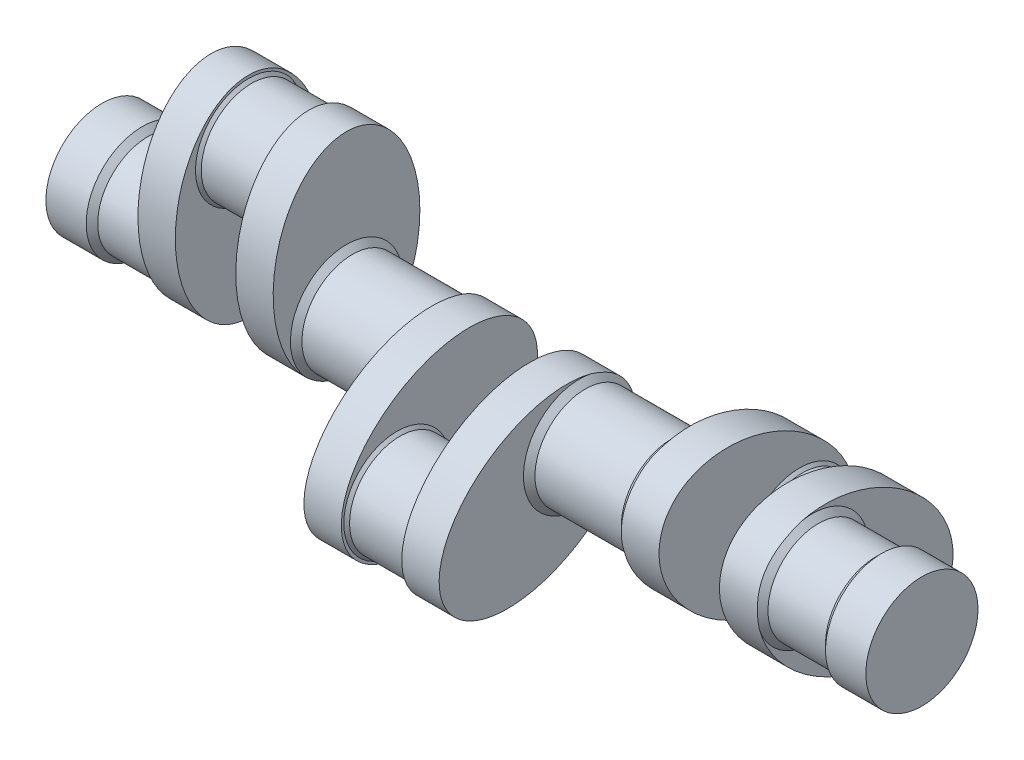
ISO-10303-21;
HEADER;
FILE_DESCRIPTION(('STEP AP214'),'2;1');
FILE_NAME('part.step','',(''),(''),'','','');
FILE_SCHEMA(('AUTOMOTIVE_DESIGN { 1 0 10303 214 1 1 1 1 }'));
ENDSEC;
DATA;
#1=APPLICATION_CONTEXT('core data for automotive mechanical design processes');
#2=APPLICATION_PROTOCOL_DEFINITION('international standard','automotive_design',2000,#1);
#3=PRODUCT_CONTEXT('',#1,'mechanical');
#4=PRODUCT('Part','Part','',(#3));
#5=PRODUCT_RELATED_PRODUCT_CATEGORY('part','',(#4));
#6=PRODUCT_DEFINITION_FORMATION('','',#4);
#7=PRODUCT_DEFINITION_CONTEXT('part definition',#1,'design');
#8=PRODUCT_DEFINITION('design','',#6,#7);
#9=PRODUCT_DEFINITION_SHAPE('','',#8);
#10=(LENGTH_UNIT() NAMED_UNIT(*) SI_UNIT(.MILLI.,.METRE.));
#11=(NAMED_UNIT(*) PLANE_ANGLE_UNIT() SI_UNIT($,.RADIAN.));
#12=(NAMED_UNIT(*) SI_UNIT($,.STERADIAN.) SOLID_ANGLE_UNIT());
#13=UNCERTAINTY_MEASURE_WITH_UNIT(LENGTH_MEASURE(1.E-05),#10,'distance_accuracy_value','');
#14=(GEOMETRIC_REPRESENTATION_CONTEXT(3) GLOBAL_UNCERTAINTY_ASSIGNED_CONTEXT((#13)) GLOBAL_UNIT_ASSIGNED_CONTEXT((#10,
#11,#12)) REPRESENTATION_CONTEXT('',''));
#15=CARTESIAN_POINT('',(0.,0.,0.));
#16=DIRECTION('',(0.,0.,1.));
#17=DIRECTION('',(1.,0.,0.));
#18=AXIS2_PLACEMENT_3D('',#15,#16,#17);
#19=CARTESIAN_POINT('',(14.,0.,0.));
#20=DIRECTION('',(-1.,0.,0.));
#21=DIRECTION('',(0.,0.,1.));
#22=AXIS2_PLACEMENT_3D('',#19,#20,#21);
#23=CYLINDRICAL_SURFACE('',#22,19.5);
#24=CARTESIAN_POINT('',(14.,0.,0.));
#25=DIRECTION('',(1.,0.,0.));
#26=DIRECTION('',(0.,0.,-1.));
#27=AXIS2_PLACEMENT_3D('',#24,#25,#26);
#28=CIRCLE('',#27,19.5);
#29=CARTESIAN_POINT('',(14.,0.,-19.5));
#30=VERTEX_POINT('',#29);
#31=EDGE_CURVE('E407',#30,#30,#28,.T.);
#32=ORIENTED_EDGE('',*,*,#31,.F.);
#33=EDGE_LOOP('',(#32));
#34=FACE_BOUND('',#33,.T.);
#35=CARTESIAN_POINT('',(0.,0.,0.));
#36=DIRECTION('',(1.,0.,0.));
#37=DIRECTION('',(0.,0.,-1.));
#38=AXIS2_PLACEMENT_3D('',#35,#36,#37);
#39=CIRCLE('',#38,19.5);
#40=CARTESIAN_POINT('',(0.,0.,-19.5));
#41=VERTEX_POINT('',#40);
#42=EDGE_CURVE('E327',#41,#41,#39,.T.);
#43=ORIENTED_EDGE('',*,*,#42,.T.);
#44=EDGE_LOOP('',(#43));
#45=FACE_BOUND('',#44,.T.);
#46=ADVANCED_FACE('F35',(#34,#45),#23,.T.);
#47=CARTESIAN_POINT('',(0.,0.,0.));
#48=DIRECTION('',(1.,0.,0.));
#49=DIRECTION('',(0.,0.,-1.));
#50=AXIS2_PLACEMENT_3D('',#47,#48,#49);
#51=PLANE('',#50);
#52=ORIENTED_EDGE('',*,*,#42,.F.);
#53=EDGE_LOOP('',(#52));
#54=FACE_BOUND('',#53,.T.);
#55=ADVANCED_FACE('F398',(#54),#51,.F.);
#56=CARTESIAN_POINT('',(38.,0.,0.));
#57=DIRECTION('',(-1.,0.,0.));
#58=DIRECTION('',(0.,0.,1.));
#59=AXIS2_PLACEMENT_3D('',#56,#57,#58);
#60=CYLINDRICAL_SURFACE('',#59,17.5);
#61=CARTESIAN_POINT('',(36.,0.,0.));
#62=DIRECTION('',(1.,0.,0.));
#63=DIRECTION('',(0.,0.,-1.));
#64=AXIS2_PLACEMENT_3D('',#61,#62,#63);
#65=CIRCLE('',#64,17.5);
#66=CARTESIAN_POINT('',(36.,0.,-17.5));
#67=VERTEX_POINT('',#66);
#68=EDGE_CURVE('E115',#67,#67,#65,.F.);
#69=ORIENTED_EDGE('',*,*,#68,.T.);
#70=EDGE_LOOP('',(#69));
#71=FACE_BOUND('',#70,.T.);
#72=CARTESIAN_POINT('',(16.0000000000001,0.,0.));
#73=DIRECTION('',(1.,0.,0.));
#74=DIRECTION('',(0.,0.,-1.));
#75=AXIS2_PLACEMENT_3D('',#72,#73,#74);
#76=CIRCLE('',#75,17.5);
#77=CARTESIAN_POINT('',(16.0000000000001,0.,-17.5));
#78=VERTEX_POINT('',#77);
#79=EDGE_CURVE('E442',#78,#78,#76,.T.);
#80=ORIENTED_EDGE('',*,*,#79,.T.);
#81=EDGE_LOOP('',(#80));
#82=FACE_BOUND('',#81,.T.);
#83=ADVANCED_FACE('F335',(#71,#82),#60,.T.);
#84=CARTESIAN_POINT('',(51.,17.,0.));
#85=DIRECTION('',(1.,0.,0.));
#86=DIRECTION('',(0.,-1.,0.));
#87=AXIS2_PLACEMENT_3D('',#84,#85,#86);
#88=ELLIPSE('',#87,36.5,25.5);
#89=DIRECTION('',(-1.,0.,0.));
#90=VECTOR('',#89,1.);
#91=SURFACE_OF_LINEAR_EXTRUSION('',#88,#90);
#92=CARTESIAN_POINT('',(51.,-19.5,0.));
#93=VERTEX_POINT('',#92);
#94=EDGE_CURVE('E323',#93,#93,#88,.T.);
#95=ORIENTED_EDGE('',*,*,#94,.F.);
#96=EDGE_LOOP('',(#95));
#97=FACE_BOUND('',#96,.T.);
#98=CARTESIAN_POINT('',(38.,-12.9171554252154,14.6081174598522));
#99=CARTESIAN_POINT('',(37.9727136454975,-13.2326370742,14.2927742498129));
#100=CARTESIAN_POINT('',(37.949980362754,-13.5407386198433,13.9695920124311));
#101=CARTESIAN_POINT('',(37.9125577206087,-14.1408228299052,13.3072850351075));
#102=CARTESIAN_POINT('',(37.8978803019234,-14.432780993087,12.9681374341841));
#103=CARTESIAN_POINT('',(37.8755760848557,-14.9984195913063,12.2743931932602));
#104=CARTESIAN_POINT('',(37.8679528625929,-15.2720906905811,11.9197888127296));
#105=CARTESIAN_POINT('',(37.8585434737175,-15.8009830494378,11.1930997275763));
#106=CARTESIAN_POINT('',(37.8567993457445,-16.0560587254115,10.820908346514));
#107=CARTESIAN_POINT('',(37.8579749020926,-16.5434870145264,10.0621796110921));
#108=CARTESIAN_POINT('',(37.8608922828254,-16.7758507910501,9.67564943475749));
#109=CARTESIAN_POINT('',(37.8700509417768,-17.215917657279,8.88898470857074));
#110=CARTESIAN_POINT('',(37.8762909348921,-17.4236302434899,8.4888554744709));
#111=CARTESIAN_POINT('',(37.8891834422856,-17.7699808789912,7.76480315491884));
#112=CARTESIAN_POINT('',(37.89544766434,-17.9137933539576,7.44333979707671));
#113=CARTESIAN_POINT('',(37.9085829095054,-18.1842916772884,6.79326955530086));
#114=CARTESIAN_POINT('',(37.9154539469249,-18.3109771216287,6.46466250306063));
#115=CARTESIAN_POINT('',(37.9292264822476,-18.5463490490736,5.80100931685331));
#116=CARTESIAN_POINT('',(37.9361279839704,-18.655033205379,5.46596235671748));
#117=CARTESIAN_POINT('',(37.9494034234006,-18.8530946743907,4.79195647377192));
#118=CARTESIAN_POINT('',(37.9557797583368,-18.9425631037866,4.45302441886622));
#119=CARTESIAN_POINT('',(37.967590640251,-19.1021455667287,3.77065513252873));
#120=CARTESIAN_POINT('',(37.9730253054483,-19.1722620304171,3.42721847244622));
#121=CARTESIAN_POINT('',(37.9825850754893,-19.2925458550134,2.7370442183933));
#122=CARTESIAN_POINT('',(37.9867109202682,-19.3427244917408,2.39030860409));
#123=CARTESIAN_POINT('',(37.9932927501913,-19.4216983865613,1.70362487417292));
#124=CARTESIAN_POINT('',(37.9957897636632,-19.4510208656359,1.36373780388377));
#125=CARTESIAN_POINT('',(37.999153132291,-19.4901936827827,0.682571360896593));
#126=CARTESIAN_POINT('',(38.000018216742,-19.5000288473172,0.341291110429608));
#127=CARTESIAN_POINT('',(38.,-19.5,0.));
#128=B_SPLINE_CURVE_WITH_KNOTS('',3,(#98,#99,#100,#101,#102,#103,#104,#105,#106,#107,#108,#109,
#110,#111,#112,#113,#114,#115,#116,#117,#118,#119,#120,#121,#122,#123,#124,#125,#126,#127),
.UNSPECIFIED.,.F.,.F.,(4,2,2,2,2,2,2,2,2,2,2,2,2,2,4),(0.,1.3405966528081,2.68317506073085,
4.02643371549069,5.37927723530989,6.73145242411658,8.08310500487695,9.13931601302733,
10.1955519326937,11.2519242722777,12.3031711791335,13.3542860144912,14.4048055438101,
15.4277218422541,16.4514343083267),.UNSPECIFIED.);
#129=CARTESIAN_POINT('',(38.,-12.9171554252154,14.6081174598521));
#130=VERTEX_POINT('',#129);
#131=CARTESIAN_POINT('',(38.,-19.5,0.));
#132=VERTEX_POINT('',#131);
#133=EDGE_CURVE('E51',#130,#132,#128,.T.);
#134=ORIENTED_EDGE('',*,*,#133,.T.);
#135=CARTESIAN_POINT('',(38.,-19.5,0.));
#136=CARTESIAN_POINT('',(38.0000148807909,-19.5000236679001,-0.324057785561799));
#137=CARTESIAN_POINT('',(37.9992364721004,-19.4911589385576,-0.648108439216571));
#138=CARTESIAN_POINT('',(37.9962014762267,-19.4558333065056,-1.29507862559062));
#139=CARTESIAN_POINT('',(37.99394563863,-19.4293813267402,-1.61799864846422));
#140=CARTESIAN_POINT('',(37.9880644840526,-19.3590674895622,-2.26186624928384));
#141=CARTESIAN_POINT('',(37.9844394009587,-19.3152086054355,-2.58281415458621));
#142=CARTESIAN_POINT('',(37.9760549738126,-19.2107493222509,-3.21983111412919));
#143=CARTESIAN_POINT('',(37.97130307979,-19.1502584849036,-3.53591827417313));
#144=CARTESIAN_POINT('',(37.9609201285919,-19.0128302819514,-4.16451416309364));
#145=CARTESIAN_POINT('',(37.9552889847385,-18.9358912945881,-4.47702253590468));
#146=CARTESIAN_POINT('',(37.9434800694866,-18.7660939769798,-5.09765973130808));
#147=CARTESIAN_POINT('',(37.937302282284,-18.6732351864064,-5.40578842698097));
#148=CARTESIAN_POINT('',(37.9211115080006,-18.4133076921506,-6.19593720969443));
#149=CARTESIAN_POINT('',(37.9109701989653,-18.2346157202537,-6.67417519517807));
#150=CARTESIAN_POINT('',(37.8919870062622,-17.841298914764,-7.61560685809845));
#151=CARTESIAN_POINT('',(37.8831452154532,-17.6266715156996,-8.07879945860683));
#152=CARTESIAN_POINT('',(37.8686296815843,-17.1637627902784,-8.98946758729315));
#153=CARTESIAN_POINT('',(37.8629636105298,-16.915401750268,-9.43690262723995));
#154=CARTESIAN_POINT('',(37.8567874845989,-16.3883679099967,-10.3134910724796));
#155=CARTESIAN_POINT('',(37.8562768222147,-16.1096986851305,-10.742646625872));
#156=CARTESIAN_POINT('',(37.8615301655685,-15.6018428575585,-11.471419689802));
#157=CARTESIAN_POINT('',(37.8656800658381,-15.3789045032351,-11.7754344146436));
#158=CARTESIAN_POINT('',(37.8785482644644,-14.9192839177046,-12.3727540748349));
#159=CARTESIAN_POINT('',(37.8872661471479,-14.682602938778,-12.6660599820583));
#160=CARTESIAN_POINT('',(37.9099052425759,-14.1976805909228,-13.2404977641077));
#161=CARTESIAN_POINT('',(37.923803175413,-13.9494952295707,-13.5216779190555));
#162=CARTESIAN_POINT('',(37.957401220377,-13.4416607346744,-14.07311561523));
#163=CARTESIAN_POINT('',(37.9771011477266,-13.1820119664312,-14.3433735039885));
#164=CARTESIAN_POINT('',(38.0000000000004,-12.9171554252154,-14.6081174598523));
#165=B_SPLINE_CURVE_WITH_KNOTS('',3,(#135,#136,#137,#138,#139,#140,#141,#142,#143,#144,#145,
#146,#147,#148,#149,#150,#151,#152,#153,#154,#155,#156,#157,#158,#159,#160,#161,#162,#163,#164),
.UNSPECIFIED.,.F.,.F.,(4,2,2,2,2,2,2,2,2,2,2,2,2,2,4),(0.,0.972039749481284,1.94358670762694,
2.91496778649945,3.88009724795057,4.84532191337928,5.81057449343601,7.34080599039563,
8.87114677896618,10.405168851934,11.9390101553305,13.0696581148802,14.2002032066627,
15.3257275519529,16.451216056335),.UNSPECIFIED.);
#166=CARTESIAN_POINT('',(38.,-12.9171554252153,-14.6081174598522));
#167=VERTEX_POINT('',#166);
#168=EDGE_CURVE('E340',#132,#167,#165,.T.);
#169=ORIENTED_EDGE('',*,*,#168,.T.);
#170=CARTESIAN_POINT('',(38.,17.,0.));
#171=DIRECTION('',(1.,0.,0.));
#172=DIRECTION('',(0.,-1.,0.));
#173=AXIS2_PLACEMENT_3D('',#170,#171,#172);
#174=ELLIPSE('',#173,36.5,25.5);
#175=EDGE_CURVE('E318',#167,#130,#174,.T.);
#176=ORIENTED_EDGE('',*,*,#175,.T.);
#177=EDGE_LOOP('',(#134,#169,#176));
#178=FACE_BOUND('',#177,.T.);
#179=ADVANCED_FACE('F329',(#97,#178),#91,.F.);
#180=CARTESIAN_POINT('',(51.,17.,0.));
#181=DIRECTION('',(1.,0.,0.));
#182=DIRECTION('',(0.,0.,-1.));
#183=AXIS2_PLACEMENT_3D('',#180,#181,#182);
#184=PLANE('',#183);
#185=CARTESIAN_POINT('',(51.,34.,0.));
#186=DIRECTION('',(1.,0.,0.));
#187=DIRECTION('',(0.,0.,-1.));
#188=AXIS2_PLACEMENT_3D('',#185,#186,#187);
#189=CIRCLE('',#188,18.5000000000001);
#190=CARTESIAN_POINT('',(51.,34.,-18.5000000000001));
#191=VERTEX_POINT('',#190);
#192=EDGE_CURVE('E11',#191,#191,#189,.F.);
#193=ORIENTED_EDGE('',*,*,#192,.T.);
#194=EDGE_LOOP('',(#193));
#195=FACE_BOUND('',#194,.T.);
#196=ORIENTED_EDGE('',*,*,#94,.T.);
#197=EDGE_LOOP('',(#196));
#198=FACE_BOUND('',#197,.T.);
#199=ADVANCED_FACE('F334',(#195,#198),#184,.T.);
#200=CARTESIAN_POINT('',(38.,17.,0.));
#201=DIRECTION('',(1.,0.,0.));
#202=DIRECTION('',(0.,0.,-1.));
#203=AXIS2_PLACEMENT_3D('',#200,#201,#202);
#204=PLANE('',#203);
#205=ORIENTED_EDGE('',*,*,#175,.F.);
#206=CARTESIAN_POINT('',(38.,0.,0.));
#207=DIRECTION('',(1.,0.,0.));
#208=DIRECTION('',(0.,0.,-1.));
#209=AXIS2_PLACEMENT_3D('',#206,#207,#208);
#210=CIRCLE('',#209,19.5);
#211=EDGE_CURVE('E439',#167,#130,#210,.T.);
#212=ORIENTED_EDGE('',*,*,#211,.T.);
#213=EDGE_LOOP('',(#205,#212));
#214=FACE_BOUND('',#213,.T.);
#215=ADVANCED_FACE('F337',(#214),#204,.F.);
#216=CARTESIAN_POINT('',(72.,34.,0.));
#217=DIRECTION('',(-1.,0.,0.));
#218=DIRECTION('',(0.,0.,1.));
#219=AXIS2_PLACEMENT_3D('',#216,#217,#218);
#220=CYLINDRICAL_SURFACE('',#219,17.5);
#221=CARTESIAN_POINT('',(71.0000000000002,34.,0.));
#222=DIRECTION('',(1.,0.,0.));
#223=DIRECTION('',(0.,0.,-1.));
#224=AXIS2_PLACEMENT_3D('',#221,#222,#223);
#225=CIRCLE('',#224,17.5);
#226=CARTESIAN_POINT('',(71.0000000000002,34.,17.5));
#227=VERTEX_POINT('',#226);
#228=EDGE_CURVE('E44',#227,#227,#225,.F.);
#229=CARTESIAN_POINT('',(52.0000000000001,34.,0.));
#230=DIRECTION('',(1.,0.,0.));
#231=DIRECTION('',(0.,0.,-1.));
#232=AXIS2_PLACEMENT_3D('',#229,#230,#231);
#233=CIRCLE('',#232,17.5);
#234=CARTESIAN_POINT('',(52.0000000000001,34.,17.5));
#235=VERTEX_POINT('',#234);
#236=EDGE_CURVE('E373',#235,#235,#233,.T.);
#237=CARTESIAN_POINT('',(71.0000000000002,34.,17.5));
#238=CARTESIAN_POINT('',(70.8020833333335,34.,17.5));
#239=CARTESIAN_POINT('',(70.6041666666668,34.,17.5));
#240=CARTESIAN_POINT('',(70.2083333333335,34.,17.5));
#241=CARTESIAN_POINT('',(70.0104166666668,34.,17.5));
#242=CARTESIAN_POINT('',(69.6145833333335,34.,17.5));
#243=CARTESIAN_POINT('',(69.4166666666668,34.,17.5));
#244=CARTESIAN_POINT('',(69.0208333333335,34.,17.5));
#245=CARTESIAN_POINT('',(68.8229166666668,34.,17.5));
#246=CARTESIAN_POINT('',(68.4270833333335,34.,17.5));
#247=CARTESIAN_POINT('',(68.2291666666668,34.,17.5));
#248=CARTESIAN_POINT('',(67.8333333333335,34.,17.5));
#249=CARTESIAN_POINT('',(67.6354166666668,34.,17.5));
#250=CARTESIAN_POINT('',(67.2395833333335,34.,17.5));
#251=CARTESIAN_POINT('',(67.0416666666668,34.,17.5));
#252=CARTESIAN_POINT('',(66.6458333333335,34.,17.5));
#253=CARTESIAN_POINT('',(66.4479166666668,34.,17.5));
#254=CARTESIAN_POINT('',(66.0520833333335,34.,17.5));
#255=CARTESIAN_POINT('',(65.8541666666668,34.,17.5));
#256=CARTESIAN_POINT('',(65.4583333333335,34.,17.5));
#257=CARTESIAN_POINT('',(65.2604166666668,34.,17.5));
#258=CARTESIAN_POINT('',(64.8645833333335,34.,17.5));
#259=CARTESIAN_POINT('',(64.6666666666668,34.,17.5));
#260=CARTESIAN_POINT('',(64.2708333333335,34.,17.5));
#261=CARTESIAN_POINT('',(64.0729166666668,34.,17.5));
#262=CARTESIAN_POINT('',(63.6770833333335,34.,17.5));
#263=CARTESIAN_POINT('',(63.4791666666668,34.,17.5));
#264=CARTESIAN_POINT('',(63.0833333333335,34.,17.5));
#265=CARTESIAN_POINT('',(62.8854166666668,34.,17.5));
#266=CARTESIAN_POINT('',(62.4895833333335,34.,17.5));
#267=CARTESIAN_POINT('',(62.2916666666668,34.,17.5));
#268=CARTESIAN_POINT('',(61.8958333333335,34.,17.5));
#269=CARTESIAN_POINT('',(61.6979166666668,34.,17.5));
#270=CARTESIAN_POINT('',(61.3020833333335,34.,17.5));
#271=CARTESIAN_POINT('',(61.1041666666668,34.,17.5));
#272=CARTESIAN_POINT('',(60.7083333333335,34.,17.5));
#273=CARTESIAN_POINT('',(60.5104166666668,34.,17.5));
#274=CARTESIAN_POINT('',(60.1145833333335,34.,17.5));
#275=CARTESIAN_POINT('',(59.9166666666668,34.,17.5));
#276=CARTESIAN_POINT('',(59.5208333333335,34.,17.5));
#277=CARTESIAN_POINT('',(59.3229166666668,34.,17.5));
#278=CARTESIAN_POINT('',(58.9270833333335,34.,17.5));
#279=CARTESIAN_POINT('',(58.7291666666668,34.,17.5));
#280=CARTESIAN_POINT('',(58.3333333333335,34.,17.5));
#281=CARTESIAN_POINT('',(58.1354166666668,34.,17.5));
#282=CARTESIAN_POINT('',(57.7395833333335,34.,17.5));
#283=CARTESIAN_POINT('',(57.5416666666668,34.,17.5));
#284=CARTESIAN_POINT('',(57.1458333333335,34.,17.5));
#285=CARTESIAN_POINT('',(56.9479166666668,34.,17.5));
#286=CARTESIAN_POINT('',(56.5520833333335,34.,17.5));
#287=CARTESIAN_POINT('',(56.3541666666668,34.,17.5));
#288=CARTESIAN_POINT('',(55.9583333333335,34.,17.5));
#289=CARTESIAN_POINT('',(55.7604166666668,34.,17.5));
#290=CARTESIAN_POINT('',(55.3645833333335,34.,17.5));
#291=CARTESIAN_POINT('',(55.1666666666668,34.,17.5));
#292=CARTESIAN_POINT('',(54.7708333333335,34.,17.5));
#293=CARTESIAN_POINT('',(54.5729166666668,34.,17.5));
#294=CARTESIAN_POINT('',(54.1770833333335,34.,17.5));
#295=CARTESIAN_POINT('',(53.9791666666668,34.,17.5));
#296=CARTESIAN_POINT('',(53.5833333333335,34.,17.5));
#297=CARTESIAN_POINT('',(53.3854166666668,34.,17.5));
#298=CARTESIAN_POINT('',(52.9895833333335,34.,17.5));
#299=CARTESIAN_POINT('',(52.7916666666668,34.,17.5));
#300=CARTESIAN_POINT('',(52.3958333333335,34.,17.5));
#301=CARTESIAN_POINT('',(52.1979166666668,34.,17.5));
#302=CARTESIAN_POINT('',(52.0000000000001,34.,17.5));
#303=B_SPLINE_CURVE_WITH_KNOTS('',3,(#237,#238,#239,#240,#241,#242,#243,#244,#245,#246,#247,
#248,#249,#250,#251,#252,#253,#254,#255,#256,#257,#258,#259,#260,#261,#262,#263,#264,#265,#266,
#267,#268,#269,#270,#271,#272,#273,#274,#275,#276,#277,#278,#279,#280,#281,#282,#283,#284,#285,
#286,#287,#288,#289,#290,#291,#292,#293,#294,#295,#296,#297,#298,#299,#300,#301,#302),
.UNSPECIFIED.,.F.,.F.,(4,2,2,2,2,2,2,2,2,2,2,2,2,2,2,2,2,2,2,2,2,2,2,2,2,2,2,2,2,2,2,2,4),(0.,
0.593750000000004,1.18750000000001,1.78125000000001,2.375,2.96875000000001,3.56250000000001,
4.15625000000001,4.75,5.34375000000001,5.93750000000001,6.53125,7.12500000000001,
7.71875000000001,8.31250000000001,8.90625000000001,9.50000000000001,10.09375,10.6875,11.28125,
11.875,12.46875,13.0625,13.65625,14.25,14.84375,15.4375,16.03125,16.625,17.21875,17.8125,
18.40625,19.),.UNSPECIFIED.);
#304=EDGE_CURVE('BSEAM308',#227,#235,#303,.T.);
#305=ORIENTED_EDGE('',*,*,#228,.T.);
#306=ORIENTED_EDGE('',*,*,#236,.T.);
#307=ORIENTED_EDGE('',*,*,#304,.T.);
#308=ORIENTED_EDGE('',*,*,#304,.F.);
#309=EDGE_LOOP('',(#305,#307,#306,#308));
#310=FACE_BOUND('',#309,.T.);
#311=ADVANCED_FACE('F308',(#310),#220,.T.);
#312=CARTESIAN_POINT('',(85.,17.,-2.56739074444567E-13));
#313=DIRECTION('',(1.,0.,0.));
#314=DIRECTION('',(0.,1.,0.));
#315=AXIS2_PLACEMENT_3D('',#312,#313,#314);
#316=ELLIPSE('',#315,36.5,25.5);
#317=DIRECTION('',(-1.,0.,0.));
#318=VECTOR('',#317,1.);
#319=SURFACE_OF_LINEAR_EXTRUSION('',#316,#318);
#320=CARTESIAN_POINT('',(85.,-12.9171554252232,-14.6081174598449));
#321=CARTESIAN_POINT('',(85.0272863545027,-13.2326370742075,-14.2927742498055));
#322=CARTESIAN_POINT('',(85.0500196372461,-13.5407386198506,-13.9695920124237));
#323=CARTESIAN_POINT('',(85.0874422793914,-14.140822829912,-13.3072850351));
#324=CARTESIAN_POINT('',(85.1021196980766,-14.4327809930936,-12.9681374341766));
#325=CARTESIAN_POINT('',(85.1244239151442,-14.9984195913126,-12.2743931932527));
#326=CARTESIAN_POINT('',(85.1320471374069,-15.2720906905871,-11.919788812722));
#327=CARTESIAN_POINT('',(85.1414565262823,-15.8009830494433,-11.1930997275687));
#328=CARTESIAN_POINT('',(85.1432006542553,-16.0560587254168,-10.8209083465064));
#329=CARTESIAN_POINT('',(85.1420250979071,-16.5434870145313,-10.0621796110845));
#330=CARTESIAN_POINT('',(85.1391077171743,-16.7758507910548,-9.67564943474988));
#331=CARTESIAN_POINT('',(85.1299490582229,-17.2159176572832,-8.88898470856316));
#332=CARTESIAN_POINT('',(85.1237090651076,-17.4236302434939,-8.48885547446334));
#333=CARTESIAN_POINT('',(85.1108165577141,-17.7699808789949,-7.76480315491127));
#334=CARTESIAN_POINT('',(85.1045523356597,-17.9137933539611,-7.4433397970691));
#335=CARTESIAN_POINT('',(85.0914170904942,-18.1842916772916,-6.79326955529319));
#336=CARTESIAN_POINT('',(85.0845460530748,-18.3109771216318,-6.46466250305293));
#337=CARTESIAN_POINT('',(85.0707735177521,-18.5463490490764,-5.80100931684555));
#338=CARTESIAN_POINT('',(85.0638720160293,-18.6550332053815,-5.4659623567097));
#339=CARTESIAN_POINT('',(85.0505965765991,-18.8530946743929,-4.7919564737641));
#340=CARTESIAN_POINT('',(85.044220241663,-18.9425631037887,-4.45302441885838));
#341=CARTESIAN_POINT('',(85.0324093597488,-19.1021455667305,-3.77065513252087));
#342=CARTESIAN_POINT('',(85.0269746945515,-19.1722620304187,-3.42721847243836));
#343=CARTESIAN_POINT('',(85.0174149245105,-19.2925458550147,-2.73704421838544));
#344=CARTESIAN_POINT('',(85.0132890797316,-19.342724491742,-2.39030860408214));
#345=CARTESIAN_POINT('',(85.0067072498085,-19.4216983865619,-1.70362487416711));
#346=CARTESIAN_POINT('',(85.0042102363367,-19.4510208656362,-1.36373780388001));
#347=CARTESIAN_POINT('',(85.000846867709,-19.4901936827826,-0.682571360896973));
#348=CARTESIAN_POINT('',(84.999981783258,-19.5000288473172,-0.341291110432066));
#349=CARTESIAN_POINT('',(85.,-19.5,-4.57832348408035E-12));
#350=B_SPLINE_CURVE_WITH_KNOTS('',3,(#320,#321,#322,#323,#324,#325,#326,#327,#328,#329,#330,
#331,#332,#333,#334,#335,#336,#337,#338,#339,#340,#341,#342,#343,#344,#345,#346,#347,#348,#349),
.UNSPECIFIED.,.F.,.F.,(4,2,2,2,2,2,2,2,2,2,2,2,2,2,4),(0.,1.34059665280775,2.68317506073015,
4.02643371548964,5.37927723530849,6.73145242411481,8.08310500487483,9.13931601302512,
10.1955519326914,11.2519242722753,12.3031711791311,13.3542860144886,14.4048055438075,
15.4277218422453,16.4514343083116),.UNSPECIFIED.);
#351=CARTESIAN_POINT('',(85.,-12.9171554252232,-14.6081174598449));
#352=VERTEX_POINT('',#351);
#353=CARTESIAN_POINT('',(85.,-19.5,-4.57832348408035E-12));
#354=VERTEX_POINT('',#353);
#355=EDGE_CURVE('E59',#352,#354,#350,.T.);
#356=ORIENTED_EDGE('',*,*,#355,.T.);
#357=CARTESIAN_POINT('',(85.,-19.5,-4.57643782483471E-12));
#358=CARTESIAN_POINT('',(84.9999851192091,-19.5000236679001,0.324057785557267));
#359=CARTESIAN_POINT('',(85.0007635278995,-19.4911589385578,0.648108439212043));
#360=CARTESIAN_POINT('',(85.0037985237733,-19.4558333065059,1.2950786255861));
#361=CARTESIAN_POINT('',(85.0060543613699,-19.4293813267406,1.61799864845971));
#362=CARTESIAN_POINT('',(85.0119355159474,-19.3590674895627,2.26186624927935));
#363=CARTESIAN_POINT('',(85.0155605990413,-19.3152086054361,2.58281415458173));
#364=CARTESIAN_POINT('',(85.0239450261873,-19.2107493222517,3.21983111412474));
#365=CARTESIAN_POINT('',(85.0286969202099,-19.1502584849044,3.53591827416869));
#366=CARTESIAN_POINT('',(85.0390798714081,-19.0128302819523,4.16451416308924));
#367=CARTESIAN_POINT('',(85.0447110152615,-18.9358912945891,4.47702253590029));
#368=CARTESIAN_POINT('',(85.0565199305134,-18.7660939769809,5.09765973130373));
#369=CARTESIAN_POINT('',(85.062697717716,-18.6732351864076,5.40578842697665));
#370=CARTESIAN_POINT('',(85.0788884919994,-18.413307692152,6.19593720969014));
#371=CARTESIAN_POINT('',(85.0890298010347,-18.2346157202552,6.67417519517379));
#372=CARTESIAN_POINT('',(85.1080129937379,-17.8412989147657,7.6156068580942));
#373=CARTESIAN_POINT('',(85.1168547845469,-17.6266715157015,8.0787994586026));
#374=CARTESIAN_POINT('',(85.1313703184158,-17.1637627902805,8.98946758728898));
#375=CARTESIAN_POINT('',(85.1370363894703,-16.9154017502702,9.4369026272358));
#376=CARTESIAN_POINT('',(85.1432125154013,-16.3883679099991,10.3134910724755));
#377=CARTESIAN_POINT('',(85.1437231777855,-16.109698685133,10.7426466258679));
#378=CARTESIAN_POINT('',(85.1384698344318,-15.601842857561,11.4714196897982));
#379=CARTESIAN_POINT('',(85.1343199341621,-15.3789045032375,11.77543441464));
#380=CARTESIAN_POINT('',(85.1214517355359,-14.9192839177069,12.3727540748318));
#381=CARTESIAN_POINT('',(85.1127338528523,-14.6826029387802,12.6660599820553));
#382=CARTESIAN_POINT('',(85.0900947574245,-14.1976805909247,13.2404977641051));
#383=CARTESIAN_POINT('',(85.0761968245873,-13.9494952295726,13.5216779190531));
#384=CARTESIAN_POINT('',(85.0425987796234,-13.441660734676,14.073115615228));
#385=CARTESIAN_POINT('',(85.0228988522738,-13.1820119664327,14.3433735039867));
#386=CARTESIAN_POINT('',(85.,-12.9171554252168,14.6081174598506));
#387=B_SPLINE_CURVE_WITH_KNOTS('',3,(#357,#358,#359,#360,#361,#362,#363,#364,#365,#366,#367,
#368,#369,#370,#371,#372,#373,#374,#375,#376,#377,#378,#379,#380,#381,#382,#383,#384,#385,#386),
.UNSPECIFIED.,.F.,.F.,(4,2,2,2,2,2,2,2,2,2,2,2,2,2,4),(0.,0.972039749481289,1.94358670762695,
2.91496778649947,3.88009724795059,4.8453219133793,5.81057449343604,7.34080599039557,
8.87114677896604,10.4051688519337,11.9390101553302,13.0696581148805,14.2002032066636,
15.3257275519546,16.4512160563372),.UNSPECIFIED.);
#388=CARTESIAN_POINT('',(85.,-12.9171554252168,14.6081174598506));
#389=VERTEX_POINT('',#388);
#390=EDGE_CURVE('E289',#354,#389,#387,.T.);
#391=ORIENTED_EDGE('',*,*,#390,.T.);
#392=EDGE_CURVE('E313',#352,#389,#316,.T.);
#393=ORIENTED_EDGE('',*,*,#392,.F.);
#394=EDGE_LOOP('',(#356,#391,#393));
#395=FACE_BOUND('',#394,.T.);
#396=CARTESIAN_POINT('',(72.,17.,-2.56739074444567E-13));
#397=DIRECTION('',(1.,0.,0.));
#398=DIRECTION('',(0.,1.,0.));
#399=AXIS2_PLACEMENT_3D('',#396,#397,#398);
#400=ELLIPSE('',#399,36.5,25.5);
#401=CARTESIAN_POINT('',(72.,53.5,0.));
#402=VERTEX_POINT('',#401);
#403=EDGE_CURVE('E319',#402,#402,#400,.T.);
#404=ORIENTED_EDGE('',*,*,#403,.T.);
#405=EDGE_LOOP('',(#404));
#406=FACE_BOUND('',#405,.T.);
#407=ADVANCED_FACE('F301',(#395,#406),#319,.F.);
#408=CARTESIAN_POINT('',(85.,17.,-2.56739074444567E-13));
#409=DIRECTION('',(1.,0.,0.));
#410=DIRECTION('',(0.,0.,-1.));
#411=AXIS2_PLACEMENT_3D('',#408,#409,#410);
#412=PLANE('',#411);
#413=ORIENTED_EDGE('',*,*,#392,.T.);
#414=CARTESIAN_POINT('',(85.,0.,0.));
#415=DIRECTION('',(1.,0.,0.));
#416=DIRECTION('',(0.,0.,-1.));
#417=AXIS2_PLACEMENT_3D('',#414,#415,#416);
#418=CIRCLE('',#417,19.5);
#419=EDGE_CURVE('E436',#389,#352,#418,.F.);
#420=ORIENTED_EDGE('',*,*,#419,.T.);
#421=EDGE_LOOP('',(#413,#420));
#422=FACE_BOUND('',#421,.T.);
#423=ADVANCED_FACE('F307',(#422),#412,.T.);
#424=CARTESIAN_POINT('',(72.,17.,-2.56739074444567E-13));
#425=DIRECTION('',(1.,0.,0.));
#426=DIRECTION('',(0.,0.,-1.));
#427=AXIS2_PLACEMENT_3D('',#424,#425,#426);
#428=PLANE('',#427);
#429=CARTESIAN_POINT('',(72.,34.,0.));
#430=DIRECTION('',(1.,0.,0.));
#431=DIRECTION('',(0.,0.,-1.));
#432=AXIS2_PLACEMENT_3D('',#429,#430,#431);
#433=CIRCLE('',#432,18.4999999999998);
#434=CARTESIAN_POINT('',(72.,34.,-18.4999999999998));
#435=VERTEX_POINT('',#434);
#436=EDGE_CURVE('E370',#435,#435,#433,.T.);
#437=ORIENTED_EDGE('',*,*,#436,.T.);
#438=EDGE_LOOP('',(#437));
#439=FACE_BOUND('',#438,.T.);
#440=ORIENTED_EDGE('',*,*,#403,.F.);
#441=EDGE_LOOP('',(#440));
#442=FACE_BOUND('',#441,.T.);
#443=ADVANCED_FACE('F309',(#439,#442),#428,.F.);
#444=CARTESIAN_POINT('',(119.,0.,0.));
#445=DIRECTION('',(-1.,0.,0.));
#446=DIRECTION('',(0.,0.,1.));
#447=AXIS2_PLACEMENT_3D('',#444,#445,#446);
#448=CYLINDRICAL_SURFACE('',#447,17.5);
#449=CARTESIAN_POINT('',(117.,0.,0.));
#450=DIRECTION('',(1.,0.,0.));
#451=DIRECTION('',(0.,0.,-1.));
#452=AXIS2_PLACEMENT_3D('',#449,#450,#451);
#453=CIRCLE('',#452,17.5);
#454=CARTESIAN_POINT('',(117.,0.,-17.5));
#455=VERTEX_POINT('',#454);
#456=EDGE_CURVE('E433',#455,#455,#453,.F.);
#457=ORIENTED_EDGE('',*,*,#456,.T.);
#458=EDGE_LOOP('',(#457));
#459=FACE_BOUND('',#458,.T.);
#460=CARTESIAN_POINT('',(87.,0.,0.));
#461=DIRECTION('',(1.,0.,0.));
#462=DIRECTION('',(0.,0.,-1.));
#463=AXIS2_PLACEMENT_3D('',#460,#461,#462);
#464=CIRCLE('',#463,17.5);
#465=CARTESIAN_POINT('',(87.,0.,-17.5));
#466=VERTEX_POINT('',#465);
#467=EDGE_CURVE('E430',#466,#466,#464,.T.);
#468=ORIENTED_EDGE('',*,*,#467,.T.);
#469=EDGE_LOOP('',(#468));
#470=FACE_BOUND('',#469,.T.);
#471=ADVANCED_FACE('F388',(#459,#470),#448,.T.);
#472=CARTESIAN_POINT('',(132.,-8.50000000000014,14.7224318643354));
#473=DIRECTION('',(1.,0.,0.));
#474=DIRECTION('',(0.,0.500000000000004,-0.866025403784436));
#475=AXIS2_PLACEMENT_3D('',#472,#473,#474);
#476=ELLIPSE('',#475,36.5,25.5);
#477=DIRECTION('',(-1.,0.,0.));
#478=VECTOR('',#477,1.);
#479=SURFACE_OF_LINEAR_EXTRUSION('',#476,#478);
#480=CARTESIAN_POINT('',(132.,9.75000000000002,-16.8874953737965));
#481=VERTEX_POINT('',#480);
#482=EDGE_CURVE('E322',#481,#481,#476,.T.);
#483=ORIENTED_EDGE('',*,*,#482,.F.);
#484=EDGE_LOOP('',(#483));
#485=FACE_BOUND('',#484,.T.);
#486=CARTESIAN_POINT('',(119.,-6.19242310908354,-18.4906434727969));
#487=CARTESIAN_POINT('',(118.972713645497,-5.7615870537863,-18.6061869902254));
#488=CARTESIAN_POINT('',(118.949980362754,-5.32765225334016,-18.7114196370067));
#489=CARTESIAN_POINT('',(118.912557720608,-4.45403548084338,-18.8999543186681));
#490=CARTESIAN_POINT('',(118.897880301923,-4.01434596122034,-18.9832237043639));
#491=CARTESIAN_POINT('',(118.875576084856,-3.13072652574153,-19.1262089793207));
#492=CARTESIAN_POINT('',(118.867952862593,-2.68679457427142,-19.1859129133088));
#493=CARTESIAN_POINT('',(118.858543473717,-1.79301718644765,-19.2806025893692));
#494=CARTESIAN_POINT('',(118.856799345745,-1.34315215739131,-19.3154089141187));
#495=CARTESIAN_POINT('',(118.857974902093,-0.442359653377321,-19.3581698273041));
#496=CARTESIAN_POINT('',(118.860892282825,0.00856718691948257,-19.3661376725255));
#497=CARTESIAN_POINT('',(118.870050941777,0.909872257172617,-19.3539143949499));
#498=CARTESIAN_POINT('',(118.876290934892,1.36025063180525,-19.3337341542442));
#499=CARTESIAN_POINT('',(118.889183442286,2.16047365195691,-19.271656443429));
#500=CARTESIAN_POINT('',(118.89544766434,2.51077532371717,-19.2354700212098));
#501=CARTESIAN_POINT('',(118.908582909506,3.20900182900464,-19.1446933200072));
#502=CARTESIAN_POINT('',(118.915453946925,3.5569266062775,-19.0901026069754));
#503=CARTESIAN_POINT('',(118.929226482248,4.24935308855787,-18.9621140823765));
#504=CARTESIAN_POINT('',(118.936127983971,4.59385434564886,-18.8887138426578));
#505=CARTESIAN_POINT('',(118.949403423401,5.27659129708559,-18.7232371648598));
#506=CARTESIAN_POINT('',(118.955779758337,5.61484928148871,-18.6312530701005));
#507=CARTESIAN_POINT('',(118.967590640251,6.28558964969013,-18.4282708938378));
#508=CARTESIAN_POINT('',(118.973025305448,6.61807275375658,-18.3172752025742));
#509=CARTESIAN_POINT('',(118.982585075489,7.27592310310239,-18.0763569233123));
#510=CARTESIAN_POINT('',(118.986710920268,7.60129427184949,-17.9464450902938));
#511=CARTESIAN_POINT('',(118.993292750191,8.2354667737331,-17.6714966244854));
#512=CARTESIAN_POINT('',(118.995789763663,8.54447885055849,-17.5269471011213));
#513=CARTESIAN_POINT('',(118.999153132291,9.15397270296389,-17.2202885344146));
#514=CARTESIAN_POINT('',(119.000018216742,9.45444765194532,-17.0581659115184));
#515=CARTESIAN_POINT('',(119.,9.75000000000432,-16.8874953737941));
#516=B_SPLINE_CURVE_WITH_KNOTS('',3,(#486,#487,#488,#489,#490,#491,#492,#493,#494,#495,#496,
#497,#498,#499,#500,#501,#502,#503,#504,#505,#506,#507,#508,#509,#510,#511,#512,#513,#514,#515),
.UNSPECIFIED.,.F.,.F.,(4,2,2,2,2,2,2,2,2,2,2,2,2,2,4),(0.,1.34059665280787,2.68317506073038,
4.02643371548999,5.37927723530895,6.7314524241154,8.08310500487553,9.13931601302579,
10.195551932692,11.2519242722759,12.3031711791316,13.3542860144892,14.404805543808,
15.4277218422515,16.4514343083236),.UNSPECIFIED.);
#517=CARTESIAN_POINT('',(119.,-6.19242310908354,-18.4906434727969));
#518=VERTEX_POINT('',#517);
#519=CARTESIAN_POINT('',(119.,9.75000000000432,-16.8874953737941));
#520=VERTEX_POINT('',#519);
#521=EDGE_CURVE('E244',#518,#520,#516,.T.);
#522=ORIENTED_EDGE('',*,*,#521,.T.);
#523=CARTESIAN_POINT('',(119.,9.75000000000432,-16.887495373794));
#524=CARTESIAN_POINT('',(119.000014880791,10.030654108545,-16.7254869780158));
#525=CARTESIAN_POINT('',(118.9992364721,10.3068578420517,-16.5557845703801));
#526=CARTESIAN_POINT('',(118.996201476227,10.8494876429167,-16.2017065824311));
#527=CARTESIAN_POINT('',(118.99394563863,11.1159185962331,-16.017338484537));
#528=CARTESIAN_POINT('',(118.988064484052,11.6383673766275,-15.6345111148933));
#529=CARTESIAN_POINT('',(118.984439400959,11.8943869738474,-15.4360542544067));
#530=CARTESIAN_POINT('',(118.976054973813,12.3938302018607,-15.0270813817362));
#531=CARTESIAN_POINT('',(118.97130307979,12.6373242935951,-14.8166511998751));
#532=CARTESIAN_POINT('',(118.960920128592,13.1129902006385,-14.3833369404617));
#533=CARTESIAN_POINT('',(118.955288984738,13.3451608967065,-14.160451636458));
#534=CARTESIAN_POINT('',(118.943480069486,13.7977498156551,-13.703084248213));
#535=CARTESIAN_POINT('',(118.937302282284,14.018167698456,-13.4686018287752));
#536=CARTESIAN_POINT('',(118.921111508,14.5724928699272,-12.8484236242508));
#537=CARTESIAN_POINT('',(118.910970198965,14.8973131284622,-12.4545528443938));
#538=CARTESIAN_POINT('',(118.891987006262,15.5159584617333,-11.6432146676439));
#539=CARTESIAN_POINT('',(118.883145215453,15.8097813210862,-11.2257455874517));
#540=CARTESIAN_POINT('',(118.868629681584,16.3669886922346,-10.3695208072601));
#541=CARTESIAN_POINT('',(118.86296361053,16.6302982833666,-9.93071631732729));
#542=CARTESIAN_POINT('',(118.856787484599,17.1259292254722,-9.03599740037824));
#543=CARTESIAN_POINT('',(118.856276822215,17.3582542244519,-8.58008499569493));
#544=CARTESIAN_POINT('',(118.861530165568,17.7354622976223,-7.775882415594));
#545=CARTESIAN_POINT('',(118.865680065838,17.8872775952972,-7.43080477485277));
#546=CARTESIAN_POINT('',(118.878548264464,18.1747613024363,-6.73410184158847));
#547=CARTESIAN_POINT('',(118.887266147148,18.3104311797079,-6.38247714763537));
#548=CARTESIAN_POINT('',(118.909905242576,18.5654477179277,-5.67530318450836));
#549=CARTESIAN_POINT('',(118.923803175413,18.684864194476,-5.31977827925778));
#550=CARTESIAN_POINT('',(118.957401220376,18.9085060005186,-4.6042618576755));
#551=CARTESIAN_POINT('',(118.977101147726,19.0127318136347,-4.24427048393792));
#552=CARTESIAN_POINT('',(118.999999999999,19.109578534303,-3.88252601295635));
#553=B_SPLINE_CURVE_WITH_KNOTS('',3,(#523,#524,#525,#526,#527,#528,#529,#530,#531,#532,#533,
#534,#535,#536,#537,#538,#539,#540,#541,#542,#543,#544,#545,#546,#547,#548,#549,#550,#551,#552),
.UNSPECIFIED.,.F.,.F.,(4,2,2,2,2,2,2,2,2,2,2,2,2,2,4),(0.,0.972039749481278,1.94358670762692,
2.91496778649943,3.88009724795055,4.84532191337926,5.810574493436,7.34080599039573,
8.87114677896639,10.4051688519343,11.9390101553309,13.0696581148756,14.200203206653,
15.3257275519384,16.4512160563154),.UNSPECIFIED.);
#554=CARTESIAN_POINT('',(119.,19.1095785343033,-3.88252601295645));
#555=VERTEX_POINT('',#554);
#556=EDGE_CURVE('E251',#520,#555,#553,.T.);
#557=ORIENTED_EDGE('',*,*,#556,.T.);
#558=CARTESIAN_POINT('',(119.,-8.50000000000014,14.7224318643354));
#559=DIRECTION('',(1.,0.,0.));
#560=DIRECTION('',(0.,0.500000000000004,-0.866025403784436));
#561=AXIS2_PLACEMENT_3D('',#558,#559,#560);
#562=ELLIPSE('',#561,36.5,25.5);
#563=EDGE_CURVE('E225',#555,#518,#562,.T.);
#564=ORIENTED_EDGE('',*,*,#563,.T.);
#565=EDGE_LOOP('',(#522,#557,#564));
#566=FACE_BOUND('',#565,.T.);
#567=ADVANCED_FACE('F257',(#485,#566),#479,.F.);
#568=CARTESIAN_POINT('',(132.,-8.50000000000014,14.7224318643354));
#569=DIRECTION('',(1.,0.,0.));
#570=DIRECTION('',(0.,0.,-1.));
#571=AXIS2_PLACEMENT_3D('',#568,#569,#570);
#572=PLANE('',#571);
#573=CARTESIAN_POINT('',(132.,-17.0000000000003,29.4448637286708));
#574=DIRECTION('',(1.,0.,0.));
#575=DIRECTION('',(0.,0.,-1.));
#576=AXIS2_PLACEMENT_3D('',#573,#574,#575);
#577=CIRCLE('',#576,18.5000000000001);
#578=CARTESIAN_POINT('',(132.,-17.0000000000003,10.9448637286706));
#579=VERTEX_POINT('',#578);
#580=EDGE_CURVE('E364',#579,#579,#577,.F.);
#581=ORIENTED_EDGE('',*,*,#580,.T.);
#582=EDGE_LOOP('',(#581));
#583=FACE_BOUND('',#582,.T.);
#584=ORIENTED_EDGE('',*,*,#482,.T.);
#585=EDGE_LOOP('',(#584));
#586=FACE_BOUND('',#585,.T.);
#587=ADVANCED_FACE('F644',(#583,#586),#572,.T.);
#588=CARTESIAN_POINT('',(119.,-8.50000000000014,14.7224318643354));
#589=DIRECTION('',(1.,0.,0.));
#590=DIRECTION('',(0.,0.,-1.));
#591=AXIS2_PLACEMENT_3D('',#588,#589,#590);
#592=PLANE('',#591);
#593=ORIENTED_EDGE('',*,*,#563,.F.);
#594=CARTESIAN_POINT('',(119.,0.,0.));
#595=DIRECTION('',(1.,0.,0.));
#596=DIRECTION('',(0.,0.,-1.));
#597=AXIS2_PLACEMENT_3D('',#594,#595,#596);
#598=CIRCLE('',#597,19.5);
#599=EDGE_CURVE('E427',#555,#518,#598,.T.);
#600=ORIENTED_EDGE('',*,*,#599,.T.);
#601=EDGE_LOOP('',(#593,#600));
#602=FACE_BOUND('',#601,.T.);
#603=ADVANCED_FACE('F637',(#602),#592,.F.);
#604=CARTESIAN_POINT('',(153.,-17.0000000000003,29.4448637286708));
#605=DIRECTION('',(-1.,0.,0.));
#606=DIRECTION('',(0.,0.,1.));
#607=AXIS2_PLACEMENT_3D('',#604,#605,#606);
#608=CYLINDRICAL_SURFACE('',#607,17.5);
#609=CARTESIAN_POINT('',(133.,-17.0000000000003,29.4448637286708));
#610=DIRECTION('',(1.,0.,0.));
#611=DIRECTION('',(0.,0.,-1.));
#612=AXIS2_PLACEMENT_3D('',#609,#610,#611);
#613=CIRCLE('',#612,17.5);
#614=CARTESIAN_POINT('',(133.,-17.0000000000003,46.9448637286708));
#615=VERTEX_POINT('',#614);
#616=EDGE_CURVE('E361',#615,#615,#613,.T.);
#617=CARTESIAN_POINT('',(152.,-17.0000000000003,29.4448637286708));
#618=DIRECTION('',(1.,0.,0.));
#619=DIRECTION('',(0.,0.,-1.));
#620=AXIS2_PLACEMENT_3D('',#617,#618,#619);
#621=CIRCLE('',#620,17.5);
#622=CARTESIAN_POINT('',(152.,-17.0000000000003,46.9448637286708));
#623=VERTEX_POINT('',#622);
#624=EDGE_CURVE('E358',#623,#623,#621,.F.);
#625=CARTESIAN_POINT('',(133.,-17.0000000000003,46.9448637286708));
#626=CARTESIAN_POINT('',(133.197916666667,-17.0000000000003,46.9448637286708));
#627=CARTESIAN_POINT('',(133.395833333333,-17.0000000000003,46.9448637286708));
#628=CARTESIAN_POINT('',(133.791666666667,-17.0000000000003,46.9448637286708));
#629=CARTESIAN_POINT('',(133.989583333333,-17.0000000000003,46.9448637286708));
#630=CARTESIAN_POINT('',(134.385416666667,-17.0000000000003,46.9448637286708));
#631=CARTESIAN_POINT('',(134.583333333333,-17.0000000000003,46.9448637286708));
#632=CARTESIAN_POINT('',(134.979166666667,-17.0000000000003,46.9448637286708));
#633=CARTESIAN_POINT('',(135.177083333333,-17.0000000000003,46.9448637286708));
#634=CARTESIAN_POINT('',(135.572916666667,-17.0000000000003,46.9448637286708));
#635=CARTESIAN_POINT('',(135.770833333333,-17.0000000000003,46.9448637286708));
#636=CARTESIAN_POINT('',(136.166666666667,-17.0000000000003,46.9448637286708));
#637=CARTESIAN_POINT('',(136.364583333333,-17.0000000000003,46.9448637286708));
#638=CARTESIAN_POINT('',(136.760416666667,-17.0000000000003,46.9448637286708));
#639=CARTESIAN_POINT('',(136.958333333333,-17.0000000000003,46.9448637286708));
#640=CARTESIAN_POINT('',(137.354166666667,-17.0000000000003,46.9448637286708));
#641=CARTESIAN_POINT('',(137.552083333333,-17.0000000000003,46.9448637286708));
#642=CARTESIAN_POINT('',(137.947916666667,-17.0000000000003,46.9448637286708));
#643=CARTESIAN_POINT('',(138.145833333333,-17.0000000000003,46.9448637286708));
#644=CARTESIAN_POINT('',(138.541666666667,-17.0000000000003,46.9448637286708));
#645=CARTESIAN_POINT('',(138.739583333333,-17.0000000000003,46.9448637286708));
#646=CARTESIAN_POINT('',(139.135416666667,-17.0000000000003,46.9448637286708));
#647=CARTESIAN_POINT('',(139.333333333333,-17.0000000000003,46.9448637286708));
#648=CARTESIAN_POINT('',(139.729166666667,-17.0000000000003,46.9448637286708));
#649=CARTESIAN_POINT('',(139.927083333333,-17.0000000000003,46.9448637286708));
#650=CARTESIAN_POINT('',(140.322916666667,-17.0000000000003,46.9448637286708));
#651=CARTESIAN_POINT('',(140.520833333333,-17.0000000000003,46.9448637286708));
#652=CARTESIAN_POINT('',(140.916666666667,-17.0000000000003,46.9448637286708));
#653=CARTESIAN_POINT('',(141.114583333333,-17.0000000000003,46.9448637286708));
#654=CARTESIAN_POINT('',(141.510416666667,-17.0000000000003,46.9448637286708));
#655=CARTESIAN_POINT('',(141.708333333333,-17.0000000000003,46.9448637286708));
#656=CARTESIAN_POINT('',(142.104166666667,-17.0000000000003,46.9448637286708));
#657=CARTESIAN_POINT('',(142.302083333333,-17.0000000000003,46.9448637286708));
#658=CARTESIAN_POINT('',(142.697916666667,-17.0000000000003,46.9448637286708));
#659=CARTESIAN_POINT('',(142.895833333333,-17.0000000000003,46.9448637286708));
#660=CARTESIAN_POINT('',(143.291666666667,-17.0000000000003,46.9448637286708));
#661=CARTESIAN_POINT('',(143.489583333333,-17.0000000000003,46.9448637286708));
#662=CARTESIAN_POINT('',(143.885416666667,-17.0000000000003,46.9448637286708));
#663=CARTESIAN_POINT('',(144.083333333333,-17.0000000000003,46.9448637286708));
#664=CARTESIAN_POINT('',(144.479166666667,-17.0000000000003,46.9448637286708));
#665=CARTESIAN_POINT('',(144.677083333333,-17.0000000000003,46.9448637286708));
#666=CARTESIAN_POINT('',(145.072916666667,-17.0000000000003,46.9448637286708));
#667=CARTESIAN_POINT('',(145.270833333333,-17.0000000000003,46.9448637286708));
#668=CARTESIAN_POINT('',(145.666666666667,-17.0000000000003,46.9448637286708));
#669=CARTESIAN_POINT('',(145.864583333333,-17.0000000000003,46.9448637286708));
#670=CARTESIAN_POINT('',(146.260416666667,-17.0000000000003,46.9448637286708));
#671=CARTESIAN_POINT('',(146.458333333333,-17.0000000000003,46.9448637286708));
#672=CARTESIAN_POINT('',(146.854166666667,-17.0000000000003,46.9448637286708));
#673=CARTESIAN_POINT('',(147.052083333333,-17.0000000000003,46.9448637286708));
#674=CARTESIAN_POINT('',(147.447916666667,-17.0000000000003,46.9448637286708));
#675=CARTESIAN_POINT('',(147.645833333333,-17.0000000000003,46.9448637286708));
#676=CARTESIAN_POINT('',(148.041666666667,-17.0000000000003,46.9448637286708));
#677=CARTESIAN_POINT('',(148.239583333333,-17.0000000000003,46.9448637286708));
#678=CARTESIAN_POINT('',(148.635416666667,-17.0000000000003,46.9448637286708));
#679=CARTESIAN_POINT('',(148.833333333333,-17.0000000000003,46.9448637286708));
#680=CARTESIAN_POINT('',(149.229166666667,-17.0000000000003,46.9448637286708));
#681=CARTESIAN_POINT('',(149.427083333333,-17.0000000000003,46.9448637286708));
#682=CARTESIAN_POINT('',(149.822916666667,-17.0000000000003,46.9448637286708));
#683=CARTESIAN_POINT('',(150.020833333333,-17.0000000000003,46.9448637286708));
#684=CARTESIAN_POINT('',(150.416666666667,-17.0000000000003,46.9448637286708));
#685=CARTESIAN_POINT('',(150.614583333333,-17.0000000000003,46.9448637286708));
#686=CARTESIAN_POINT('',(151.010416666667,-17.0000000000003,46.9448637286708));
#687=CARTESIAN_POINT('',(151.208333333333,-17.0000000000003,46.9448637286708));
#688=CARTESIAN_POINT('',(151.604166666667,-17.0000000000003,46.9448637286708));
#689=CARTESIAN_POINT('',(151.802083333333,-17.0000000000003,46.9448637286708));
#690=CARTESIAN_POINT('',(152.,-17.0000000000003,46.9448637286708));
#691=B_SPLINE_CURVE_WITH_KNOTS('',3,(#625,#626,#627,#628,#629,#630,#631,#632,#633,#634,#635,
#636,#637,#638,#639,#640,#641,#642,#643,#644,#645,#646,#647,#648,#649,#650,#651,#652,#653,#654,
#655,#656,#657,#658,#659,#660,#661,#662,#663,#664,#665,#666,#667,#668,#669,#670,#671,#672,#673,
#674,#675,#676,#677,#678,#679,#680,#681,#682,#683,#684,#685,#686,#687,#688,#689,#690),
.UNSPECIFIED.,.F.,.F.,(4,2,2,2,2,2,2,2,2,2,2,2,2,2,2,2,2,2,2,2,2,2,2,2,2,2,2,2,2,2,2,2,4),(0.,
0.593750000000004,1.18750000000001,1.78125000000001,2.37500000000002,2.96875000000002,3.5625,
4.15625,4.75,5.34375000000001,5.93750000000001,6.53125000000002,7.12500000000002,7.71875,8.3125,
8.90625,9.50000000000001,10.09375,10.6875,11.28125,11.875,12.46875,13.0625,13.65625,14.25,
14.84375,15.4375,16.03125,16.625,17.21875,17.8125,18.40625,19.),.UNSPECIFIED.);
#692=EDGE_CURVE('BSEAM233',#615,#623,#691,.T.);
#693=ORIENTED_EDGE('',*,*,#616,.T.);
#694=ORIENTED_EDGE('',*,*,#624,.T.);
#695=ORIENTED_EDGE('',*,*,#692,.T.);
#696=ORIENTED_EDGE('',*,*,#692,.F.);
#697=EDGE_LOOP('',(#693,#695,#694,#696));
#698=FACE_BOUND('',#697,.T.);
#699=ADVANCED_FACE('F233',(#698),#608,.T.);
#700=CARTESIAN_POINT('',(166.,-8.50000000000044,14.7224318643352));
#701=DIRECTION('',(1.,0.,0.));
#702=DIRECTION('',(0.,0.500000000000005,-0.866025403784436));
#703=AXIS2_PLACEMENT_3D('',#700,#701,#702);
#704=ELLIPSE('',#703,36.5,25.5);
#705=DIRECTION('',(-1.,0.,0.));
#706=VECTOR('',#705,1.);
#707=SURFACE_OF_LINEAR_EXTRUSION('',#704,#706);
#708=CARTESIAN_POINT('',(166.,19.1095785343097,-3.88252601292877));
#709=VERTEX_POINT('',#708);
#710=CARTESIAN_POINT('',(166.,-6.19242310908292,-18.4906434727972));
#711=VERTEX_POINT('',#710);
#712=EDGE_CURVE('E221',#709,#711,#704,.T.);
#713=ORIENTED_EDGE('',*,*,#712,.F.);
#714=CARTESIAN_POINT('',(166.,19.1095785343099,-3.88252601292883));
#715=CARTESIAN_POINT('',(166.027286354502,18.9942241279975,-4.31341274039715));
#716=CARTESIAN_POINT('',(166.050019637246,18.8683908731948,-4.74182762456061));
#717=CARTESIAN_POINT('',(166.087442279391,18.5948583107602,-5.59266928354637));
#718=CARTESIAN_POINT('',(166.102119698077,18.447126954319,-6.01508627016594));
#719=CARTESIAN_POINT('',(166.124423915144,18.1291461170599,-6.85181578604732));
#720=CARTESIAN_POINT('',(166.132047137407,17.9588852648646,-7.26612410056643));
#721=CARTESIAN_POINT('',(166.141456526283,17.5940002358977,-8.08750286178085));
#722=CARTESIAN_POINT('',(166.143200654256,17.3992108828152,-8.49450056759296));
#723=CARTESIAN_POINT('',(166.142025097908,16.9858466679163,-9.29599021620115));
#724=CARTESIAN_POINT('',(166.139107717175,16.7672836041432,-9.6904882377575));
#725=CARTESIAN_POINT('',(166.129949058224,16.3060454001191,-10.4649296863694));
#726=CARTESIAN_POINT('',(166.123709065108,16.0633796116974,-10.844878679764));
#727=CARTESIAN_POINT('',(166.110816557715,15.6095072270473,-11.5068532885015));
#728=CARTESIAN_POINT('',(166.10455233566,15.4030180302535,-11.7921302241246));
#729=CARTESIAN_POINT('',(166.091417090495,14.975289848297,-12.3514237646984));
#730=CARTESIAN_POINT('',(166.084546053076,14.7540505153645,-12.6254401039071));
#731=CARTESIAN_POINT('',(166.070773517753,14.2969959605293,-13.1611047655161));
#732=CARTESIAN_POINT('',(166.06387201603,14.0611788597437,-13.4227514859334));
#733=CARTESIAN_POINT('',(166.0505965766,13.5765033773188,-13.9312806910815));
#734=CARTESIAN_POINT('',(166.044220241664,13.3277138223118,-14.1782286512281));
#735=CARTESIAN_POINT('',(166.032409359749,12.8165559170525,-14.6576157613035));
#736=CARTESIAN_POINT('',(166.026974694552,12.5541892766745,-14.8900567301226));
#737=CARTESIAN_POINT('',(166.017414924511,12.0166227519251,-15.3393127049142));
#738=CARTESIAN_POINT('',(166.013289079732,11.7414302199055,-15.5561364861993));
#739=CARTESIAN_POINT('',(166.006707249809,11.186231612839,-15.9678717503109));
#740=CARTESIAN_POINT('',(166.004210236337,10.9065420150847,-16.1632092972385));
#741=CARTESIAN_POINT('',(166.000846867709,10.3362209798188,-16.5377171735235));
#742=CARTESIAN_POINT('',(165.999981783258,10.0455811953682,-16.7168748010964));
#743=CARTESIAN_POINT('',(166.,9.74999999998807,-16.8874953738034));
#744=B_SPLINE_CURVE_WITH_KNOTS('',3,(#714,#715,#716,#717,#718,#719,#720,#721,#722,#723,#724,
#725,#726,#727,#728,#729,#730,#731,#732,#733,#734,#735,#736,#737,#738,#739,#740,#741,#742,#743),
.UNSPECIFIED.,.F.,.F.,(4,2,2,2,2,2,2,2,2,2,2,2,2,2,4),(0.,1.34059665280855,2.68317506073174,
4.02643371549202,5.37927723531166,6.73145242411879,8.08310500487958,9.13931601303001,
10.1955519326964,11.2519242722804,12.3031711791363,13.354286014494,14.404805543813,
15.4277218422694,16.4514343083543),.UNSPECIFIED.);
#745=CARTESIAN_POINT('',(166.,9.74999999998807,-16.8874953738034));
#746=VERTEX_POINT('',#745);
#747=EDGE_CURVE('E238',#709,#746,#744,.T.);
#748=ORIENTED_EDGE('',*,*,#747,.T.);
#749=CARTESIAN_POINT('',(166.,9.74999999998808,-16.8874953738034));
#750=CARTESIAN_POINT('',(165.999985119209,9.4693695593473,-17.0495447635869));
#751=CARTESIAN_POINT('',(166.0007635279,9.18430109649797,-17.2038930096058));
#752=CARTESIAN_POINT('',(166.003798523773,8.60634566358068,-17.4967852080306));
#753=CARTESIAN_POINT('',(166.00605436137,8.31346273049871,-17.63533713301));
#754=CARTESIAN_POINT('',(166.011935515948,7.72070011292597,-17.8963773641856));
#755=CARTESIAN_POINT('',(166.015560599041,7.42082163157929,-18.0188684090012));
#756=CARTESIAN_POINT('',(166.023945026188,6.8169191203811,-18.2469124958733));
#757=CARTESIAN_POINT('',(166.02869692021,6.51293419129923,-18.3525694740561));
#758=CARTESIAN_POINT('',(166.039079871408,5.89984008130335,-18.5478511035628));
#759=CARTESIAN_POINT('',(166.044711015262,5.59073039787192,-18.63747417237));
#760=CARTESIAN_POINT('',(166.056519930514,4.96834416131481,-18.8007439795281));
#761=CARTESIAN_POINT('',(166.062697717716,4.65506748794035,-18.874390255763));
#762=CARTESIAN_POINT('',(166.078888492,3.84081482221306,-19.0443608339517));
#763=CARTESIAN_POINT('',(166.089029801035,3.33730259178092,-19.1287280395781));
#764=CARTESIAN_POINT('',(166.108012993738,2.32534045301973,-19.2588215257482));
#765=CARTESIAN_POINT('',(166.116854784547,1.81689019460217,-19.3045450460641));
#766=CARTESIAN_POINT('',(166.131370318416,0.796774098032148,-19.3589883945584));
#767=CARTESIAN_POINT('',(166.13703638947,0.285103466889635,-19.3676189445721));
#768=CARTESIAN_POINT('',(166.143212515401,-0.737561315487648,-19.3494884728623));
#769=CARTESIAN_POINT('',(166.143723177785,-1.24855553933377,-19.3227316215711));
#770=CARTESIAN_POINT('',(166.138469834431,-2.13361944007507,-19.2473021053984));
#771=CARTESIAN_POINT('',(166.134319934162,-2.50837309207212,-19.2062391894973));
#772=CARTESIAN_POINT('',(166.121451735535,-3.25547738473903,-19.1068559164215));
#773=CARTESIAN_POINT('',(166.112733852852,-3.6278282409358,-19.0485371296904));
#774=CARTESIAN_POINT('',(166.090094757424,-4.36776712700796,-18.9158009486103));
#775=CARTESIAN_POINT('',(166.076196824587,-4.73536896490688,-18.8414561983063));
#776=CARTESIAN_POINT('',(166.042598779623,-5.46684526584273,-18.6773774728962));
#777=CARTESIAN_POINT('',(166.022898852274,-5.83071984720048,-18.5876439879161));
#778=CARTESIAN_POINT('',(166.,-6.19242310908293,-18.4906434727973));
#779=B_SPLINE_CURVE_WITH_KNOTS('',3,(#749,#750,#751,#752,#753,#754,#755,#756,#757,#758,#759,
#760,#761,#762,#763,#764,#765,#766,#767,#768,#769,#770,#771,#772,#773,#774,#775,#776,#777,#778),
.UNSPECIFIED.,.F.,.F.,(4,2,2,2,2,2,2,2,2,2,2,2,2,2,4),(0.,0.97203974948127,1.94358670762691,
2.91496778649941,3.88009724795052,4.84532191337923,5.81057449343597,7.34080599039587,
8.87114677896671,10.4051688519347,11.9390101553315,13.0696581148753,14.2002032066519,
15.3257275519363,16.4512160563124),.UNSPECIFIED.);
#780=EDGE_CURVE('E199',#746,#711,#779,.T.);
#781=ORIENTED_EDGE('',*,*,#780,.T.);
#782=EDGE_LOOP('',(#713,#748,#781));
#783=FACE_BOUND('',#782,.T.);
#784=CARTESIAN_POINT('',(153.,-8.50000000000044,14.7224318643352));
#785=DIRECTION('',(1.,0.,0.));
#786=DIRECTION('',(0.,0.500000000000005,-0.866025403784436));
#787=AXIS2_PLACEMENT_3D('',#784,#785,#786);
#788=ELLIPSE('',#787,36.5,25.5);
#789=CARTESIAN_POINT('',(153.,9.74999999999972,-16.8874953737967));
#790=VERTEX_POINT('',#789);
#791=EDGE_CURVE('E219',#790,#790,#788,.T.);
#792=ORIENTED_EDGE('',*,*,#791,.T.);
#793=EDGE_LOOP('',(#792));
#794=FACE_BOUND('',#793,.T.);
#795=ADVANCED_FACE('F227',(#783,#794),#707,.F.);
#796=CARTESIAN_POINT('',(166.,-8.50000000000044,14.7224318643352));
#797=DIRECTION('',(1.,0.,0.));
#798=DIRECTION('',(0.,0.,-1.));
#799=AXIS2_PLACEMENT_3D('',#796,#797,#798);
#800=PLANE('',#799);
#801=ORIENTED_EDGE('',*,*,#712,.T.);
#802=CARTESIAN_POINT('',(166.,0.,0.));
#803=DIRECTION('',(1.,0.,0.));
#804=DIRECTION('',(0.,0.,-1.));
#805=AXIS2_PLACEMENT_3D('',#802,#803,#804);
#806=CIRCLE('',#805,19.5);
#807=EDGE_CURVE('E425',#711,#709,#806,.F.);
#808=ORIENTED_EDGE('',*,*,#807,.T.);
#809=EDGE_LOOP('',(#801,#808));
#810=FACE_BOUND('',#809,.T.);
#811=ADVANCED_FACE('F232',(#810),#800,.T.);
#812=CARTESIAN_POINT('',(153.,-8.50000000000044,14.7224318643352));
#813=DIRECTION('',(1.,0.,0.));
#814=DIRECTION('',(0.,0.,-1.));
#815=AXIS2_PLACEMENT_3D('',#812,#813,#814);
#816=PLANE('',#815);
#817=CARTESIAN_POINT('',(153.,-17.0000000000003,29.4448637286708));
#818=DIRECTION('',(1.,0.,0.));
#819=DIRECTION('',(0.,0.,-1.));
#820=AXIS2_PLACEMENT_3D('',#817,#818,#819);
#821=CIRCLE('',#820,18.4999999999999);
#822=CARTESIAN_POINT('',(153.,-17.0000000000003,10.9448637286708));
#823=VERTEX_POINT('',#822);
#824=EDGE_CURVE('E367',#823,#823,#821,.T.);
#825=ORIENTED_EDGE('',*,*,#824,.T.);
#826=EDGE_LOOP('',(#825));
#827=FACE_BOUND('',#826,.T.);
#828=ORIENTED_EDGE('',*,*,#791,.F.);
#829=EDGE_LOOP('',(#828));
#830=FACE_BOUND('',#829,.T.);
#831=ADVANCED_FACE('F235',(#827,#830),#816,.F.);
#832=CARTESIAN_POINT('',(200.,0.,0.));
#833=DIRECTION('',(-1.,0.,0.));
#834=DIRECTION('',(0.,0.,1.));
#835=AXIS2_PLACEMENT_3D('',#832,#833,#834);
#836=CYLINDRICAL_SURFACE('',#835,17.5);
#837=CARTESIAN_POINT('',(198.,0.,0.));
#838=DIRECTION('',(1.,0.,0.));
#839=DIRECTION('',(0.,0.,-1.));
#840=AXIS2_PLACEMENT_3D('',#837,#838,#839);
#841=CIRCLE('',#840,17.5);
#842=CARTESIAN_POINT('',(198.,0.,-17.5));
#843=VERTEX_POINT('',#842);
#844=EDGE_CURVE('E422',#843,#843,#841,.F.);
#845=ORIENTED_EDGE('',*,*,#844,.T.);
#846=EDGE_LOOP('',(#845));
#847=FACE_BOUND('',#846,.T.);
#848=CARTESIAN_POINT('',(168.,0.,0.));
#849=DIRECTION('',(1.,0.,0.));
#850=DIRECTION('',(0.,0.,-1.));
#851=AXIS2_PLACEMENT_3D('',#848,#849,#850);
#852=CIRCLE('',#851,17.5);
#853=CARTESIAN_POINT('',(168.,0.,-17.5));
#854=VERTEX_POINT('',#853);
#855=EDGE_CURVE('E419',#854,#854,#852,.T.);
#856=ORIENTED_EDGE('',*,*,#855,.T.);
#857=EDGE_LOOP('',(#856));
#858=FACE_BOUND('',#857,.T.);
#859=ADVANCED_FACE('F212',(#847,#858),#836,.T.);
#860=CARTESIAN_POINT('',(213.,-8.49999999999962,-14.7224318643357));
#861=DIRECTION('',(1.,0.,0.));
#862=DIRECTION('',(0.,0.499999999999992,0.866025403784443));
#863=AXIS2_PLACEMENT_3D('',#860,#861,#862);
#864=ELLIPSE('',#863,36.5,25.5);
#865=DIRECTION('',(-1.,0.,0.));
#866=VECTOR('',#865,1.);
#867=SURFACE_OF_LINEAR_EXTRUSION('',#864,#866);
#868=CARTESIAN_POINT('',(213.,9.75000000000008,16.8874953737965));
#869=VERTEX_POINT('',#868);
#870=EDGE_CURVE('E130',#869,#869,#864,.T.);
#871=ORIENTED_EDGE('',*,*,#870,.F.);
#872=EDGE_LOOP('',(#871));
#873=FACE_BOUND('',#872,.T.);
#874=CARTESIAN_POINT('',(200.,19.1095785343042,3.88252601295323));
#875=CARTESIAN_POINT('',(199.972713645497,18.9942241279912,4.31341274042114));
#876=CARTESIAN_POINT('',(199.949980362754,18.8683908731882,4.7418276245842));
#877=CARTESIAN_POINT('',(199.912557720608,18.5948583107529,5.5926692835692));
#878=CARTESIAN_POINT('',(199.897880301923,18.4471269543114,6.01508627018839));
#879=CARTESIAN_POINT('',(199.875576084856,18.1291461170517,6.851815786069));
#880=CARTESIAN_POINT('',(199.867952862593,17.9588852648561,7.2661241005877));
#881=CARTESIAN_POINT('',(199.858543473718,17.5940002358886,8.08750286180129));
#882=CARTESIAN_POINT('',(199.856799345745,17.3992108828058,8.49450056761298));
#883=CARTESIAN_POINT('',(199.857974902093,16.9858466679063,9.2959902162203));
#884=CARTESIAN_POINT('',(199.860892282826,16.767283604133,9.69048823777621));
#885=CARTESIAN_POINT('',(199.870050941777,16.3060454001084,10.4649296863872));
#886=CARTESIAN_POINT('',(199.876290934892,16.0633796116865,10.8448786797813));
#887=CARTESIAN_POINT('',(199.889183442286,15.6095072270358,11.5068532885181));
#888=CARTESIAN_POINT('',(199.89544766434,15.4030180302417,11.792130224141));
#889=CARTESIAN_POINT('',(199.908582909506,14.9752898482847,12.3514237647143));
#890=CARTESIAN_POINT('',(199.915453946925,14.754050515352,12.6254401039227));
#891=CARTESIAN_POINT('',(199.929226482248,14.2969959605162,13.1611047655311));
#892=CARTESIAN_POINT('',(199.936127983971,14.0611788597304,13.4227514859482));
#893=CARTESIAN_POINT('',(199.949403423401,13.5765033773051,13.9312806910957));
#894=CARTESIAN_POINT('',(199.955779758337,13.3277138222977,14.178228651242));
#895=CARTESIAN_POINT('',(199.967590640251,12.8165559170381,14.6576157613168));
#896=CARTESIAN_POINT('',(199.973025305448,12.5541892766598,14.8900567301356));
#897=CARTESIAN_POINT('',(199.982585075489,12.01662275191,15.3393127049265));
#898=CARTESIAN_POINT('',(199.986710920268,11.7414302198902,15.5561364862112));
#899=CARTESIAN_POINT('',(199.993292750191,11.1862316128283,15.9678717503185));
#900=CARTESIAN_POINT('',(199.995789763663,10.906542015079,16.1632092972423));
#901=CARTESIAN_POINT('',(199.999153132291,10.3362209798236,16.5377171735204));
#902=CARTESIAN_POINT('',(200.000018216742,10.0455811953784,16.7168748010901));
#903=CARTESIAN_POINT('',(200.,9.75000000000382,16.8874953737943));
#904=B_SPLINE_CURVE_WITH_KNOTS('',3,(#874,#875,#876,#877,#878,#879,#880,#881,#882,#883,#884,
#885,#886,#887,#888,#889,#890,#891,#892,#893,#894,#895,#896,#897,#898,#899,#900,#901,#902,#903),
.UNSPECIFIED.,.F.,.F.,(4,2,2,2,2,2,2,2,2,2,2,2,2,2,4),(0.,1.34059665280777,2.68317506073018,
4.02643371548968,5.37927723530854,6.7314524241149,8.08310500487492,9.13931601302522,
10.1955519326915,11.2519242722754,12.3031711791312,13.3542860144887,14.4048055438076,
15.4277218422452,16.4514343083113),.UNSPECIFIED.);
#905=CARTESIAN_POINT('',(200.,19.1095785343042,3.88252601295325));
#906=VERTEX_POINT('',#905);
#907=CARTESIAN_POINT('',(200.,9.75000000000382,16.8874953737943));
#908=VERTEX_POINT('',#907);
#909=EDGE_CURVE('E162',#906,#908,#904,.T.);
#910=ORIENTED_EDGE('',*,*,#909,.T.);
#911=CARTESIAN_POINT('',(200.,9.75000000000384,16.8874953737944));
#912=CARTESIAN_POINT('',(200.000014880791,9.46936955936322,17.049544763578));
#913=CARTESIAN_POINT('',(199.9992364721,9.18430109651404,17.2038930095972));
#914=CARTESIAN_POINT('',(199.996201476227,8.60634566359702,17.4967852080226));
#915=CARTESIAN_POINT('',(199.99394563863,8.31346273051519,17.6353371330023));
#916=CARTESIAN_POINT('',(199.988064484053,7.72070011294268,17.8963773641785));
#917=CARTESIAN_POINT('',(199.984439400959,7.42082163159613,18.0188684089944));
#918=CARTESIAN_POINT('',(199.976054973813,6.81691912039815,18.2469124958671));
#919=CARTESIAN_POINT('',(199.97130307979,6.51293419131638,18.3525694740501));
#920=CARTESIAN_POINT('',(199.960920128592,5.89984008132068,18.5478511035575));
#921=CARTESIAN_POINT('',(199.955288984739,5.59073039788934,18.6374741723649));
#922=CARTESIAN_POINT('',(199.943480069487,4.96834416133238,18.8007439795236));
#923=CARTESIAN_POINT('',(199.937302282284,4.65506748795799,18.8743902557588));
#924=CARTESIAN_POINT('',(199.921111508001,3.84081482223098,19.0443608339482));
#925=CARTESIAN_POINT('',(199.910970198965,3.33730259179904,19.128728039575));
#926=CARTESIAN_POINT('',(199.891987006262,2.32534045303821,19.258821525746));
#927=CARTESIAN_POINT('',(199.883145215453,1.81689019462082,19.3045450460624));
#928=CARTESIAN_POINT('',(199.868629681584,0.796774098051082,19.3589883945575));
#929=CARTESIAN_POINT('',(199.86296361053,0.285103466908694,19.3676189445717));
#930=CARTESIAN_POINT('',(199.856787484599,-0.737561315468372,19.3494884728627));
#931=CARTESIAN_POINT('',(199.856276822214,-1.2485555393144,19.3227316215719));
#932=CARTESIAN_POINT('',(199.861530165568,-2.1336194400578,19.2473021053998));
#933=CARTESIAN_POINT('',(199.865680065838,-2.50837309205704,19.2062391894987));
#934=CARTESIAN_POINT('',(199.878548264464,-3.25547738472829,19.1068559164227));
#935=CARTESIAN_POINT('',(199.887266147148,-3.62782824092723,19.0485371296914));
#936=CARTESIAN_POINT('',(199.909905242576,-4.36776712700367,18.9158009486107));
#937=CARTESIAN_POINT('',(199.923803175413,-4.7353689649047,18.8414561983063));
#938=CARTESIAN_POINT('',(199.957401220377,-5.46684526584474,18.6773774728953));
#939=CARTESIAN_POINT('',(199.977101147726,-5.83071984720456,18.5876439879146));
#940=CARTESIAN_POINT('',(200.,-6.19242310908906,18.4906434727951));
#941=B_SPLINE_CURVE_WITH_KNOTS('',3,(#911,#912,#913,#914,#915,#916,#917,#918,#919,#920,#921,
#922,#923,#924,#925,#926,#927,#928,#929,#930,#931,#932,#933,#934,#935,#936,#937,#938,#939,#940),
.UNSPECIFIED.,.F.,.F.,(4,2,2,2,2,2,2,2,2,2,2,2,2,2,4),(0.,0.97203974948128,1.94358670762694,
2.91496778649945,3.88009724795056,4.84532191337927,5.810574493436,7.34080599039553,
8.87114677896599,10.4051688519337,11.9390101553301,13.0696581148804,14.2002032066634,
15.3257275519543,16.4512160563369),.UNSPECIFIED.);
#942=CARTESIAN_POINT('',(200.,-6.19242310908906,18.4906434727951));
#943=VERTEX_POINT('',#942);
#944=EDGE_CURVE('E193',#908,#943,#941,.T.);
#945=ORIENTED_EDGE('',*,*,#944,.T.);
#946=CARTESIAN_POINT('',(200.,-8.49999999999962,-14.7224318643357));
#947=DIRECTION('',(1.,0.,0.));
#948=DIRECTION('',(0.,0.499999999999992,0.866025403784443));
#949=AXIS2_PLACEMENT_3D('',#946,#947,#948);
#950=ELLIPSE('',#949,36.5,25.5);
#951=EDGE_CURVE('E126',#943,#906,#950,.T.);
#952=ORIENTED_EDGE('',*,*,#951,.T.);
#953=EDGE_LOOP('',(#910,#945,#952));
#954=FACE_BOUND('',#953,.T.);
#955=ADVANCED_FACE('F206',(#873,#954),#867,.F.);
#956=CARTESIAN_POINT('',(213.,-8.49999999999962,-14.7224318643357));
#957=DIRECTION('',(1.,0.,0.));
#958=DIRECTION('',(0.,0.,-1.));
#959=AXIS2_PLACEMENT_3D('',#956,#957,#958);
#960=PLANE('',#959);
#961=CARTESIAN_POINT('',(213.,-17.0000000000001,-29.4448637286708));
#962=DIRECTION('',(1.,0.,0.));
#963=DIRECTION('',(0.,0.,-1.));
#964=AXIS2_PLACEMENT_3D('',#961,#962,#963);
#965=CIRCLE('',#964,18.5);
#966=CARTESIAN_POINT('',(213.,-17.0000000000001,-47.9448637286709));
#967=VERTEX_POINT('',#966);
#968=EDGE_CURVE('E355',#967,#967,#965,.F.);
#969=ORIENTED_EDGE('',*,*,#968,.T.);
#970=EDGE_LOOP('',(#969));
#971=FACE_BOUND('',#970,.T.);
#972=ORIENTED_EDGE('',*,*,#870,.T.);
#973=EDGE_LOOP('',(#972));
#974=FACE_BOUND('',#973,.T.);
#975=ADVANCED_FACE('F211',(#971,#974),#960,.T.);
#976=CARTESIAN_POINT('',(200.,-8.49999999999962,-14.7224318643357));
#977=DIRECTION('',(1.,0.,0.));
#978=DIRECTION('',(0.,0.,-1.));
#979=AXIS2_PLACEMENT_3D('',#976,#977,#978);
#980=PLANE('',#979);
#981=ORIENTED_EDGE('',*,*,#951,.F.);
#982=CARTESIAN_POINT('',(200.,0.,0.));
#983=DIRECTION('',(1.,0.,0.));
#984=DIRECTION('',(0.,0.,-1.));
#985=AXIS2_PLACEMENT_3D('',#982,#983,#984);
#986=CIRCLE('',#985,19.5);
#987=EDGE_CURVE('E121',#943,#906,#986,.T.);
#988=ORIENTED_EDGE('',*,*,#987,.T.);
#989=EDGE_LOOP('',(#981,#988));
#990=FACE_BOUND('',#989,.T.);
#991=ADVANCED_FACE('F214',(#990),#980,.F.);
#992=CARTESIAN_POINT('',(234.,-17.0000000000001,-29.4448637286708));
#993=DIRECTION('',(-1.,0.,0.));
#994=DIRECTION('',(0.,0.,1.));
#995=AXIS2_PLACEMENT_3D('',#992,#993,#994);
#996=CYLINDRICAL_SURFACE('',#995,17.5);
#997=CARTESIAN_POINT('',(233.,-17.0000000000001,-29.4448637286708));
#998=DIRECTION('',(1.,0.,0.));
#999=DIRECTION('',(0.,0.,-1.));
#1000=AXIS2_PLACEMENT_3D('',#997,#998,#999);
#1001=CIRCLE('',#1000,17.5);
#1002=CARTESIAN_POINT('',(233.,-17.0000000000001,-11.9448637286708));
#1003=VERTEX_POINT('',#1002);
#1004=EDGE_CURVE('E352',#1003,#1003,#1001,.F.);
#1005=CARTESIAN_POINT('',(214.,-17.0000000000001,-29.4448637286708));
#1006=DIRECTION('',(1.,0.,0.));
#1007=DIRECTION('',(0.,0.,-1.));
#1008=AXIS2_PLACEMENT_3D('',#1005,#1006,#1007);
#1009=CIRCLE('',#1008,17.5);
#1010=CARTESIAN_POINT('',(214.,-17.0000000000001,-11.9448637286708));
#1011=VERTEX_POINT('',#1010);
#1012=EDGE_CURVE('E349',#1011,#1011,#1009,.T.);
#1013=CARTESIAN_POINT('',(233.,-17.0000000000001,-11.9448637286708));
#1014=CARTESIAN_POINT('',(232.802083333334,-17.0000000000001,-11.9448637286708));
#1015=CARTESIAN_POINT('',(232.604166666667,-17.0000000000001,-11.9448637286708));
#1016=CARTESIAN_POINT('',(232.208333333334,-17.0000000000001,-11.9448637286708));
#1017=CARTESIAN_POINT('',(232.010416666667,-17.0000000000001,-11.9448637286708));
#1018=CARTESIAN_POINT('',(231.614583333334,-17.0000000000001,-11.9448637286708));
#1019=CARTESIAN_POINT('',(231.416666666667,-17.0000000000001,-11.9448637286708));
#1020=CARTESIAN_POINT('',(231.020833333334,-17.0000000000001,-11.9448637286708));
#1021=CARTESIAN_POINT('',(230.822916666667,-17.0000000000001,-11.9448637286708));
#1022=CARTESIAN_POINT('',(230.427083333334,-17.0000000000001,-11.9448637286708));
#1023=CARTESIAN_POINT('',(230.229166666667,-17.0000000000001,-11.9448637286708));
#1024=CARTESIAN_POINT('',(229.833333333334,-17.0000000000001,-11.9448637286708));
#1025=CARTESIAN_POINT('',(229.635416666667,-17.0000000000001,-11.9448637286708));
#1026=CARTESIAN_POINT('',(229.239583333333,-17.0000000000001,-11.9448637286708));
#1027=CARTESIAN_POINT('',(229.041666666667,-17.0000000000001,-11.9448637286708));
#1028=CARTESIAN_POINT('',(228.645833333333,-17.0000000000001,-11.9448637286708));
#1029=CARTESIAN_POINT('',(228.447916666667,-17.0000000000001,-11.9448637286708));
#1030=CARTESIAN_POINT('',(228.052083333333,-17.0000000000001,-11.9448637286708));
#1031=CARTESIAN_POINT('',(227.854166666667,-17.0000000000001,-11.9448637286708));
#1032=CARTESIAN_POINT('',(227.458333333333,-17.0000000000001,-11.9448637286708));
#1033=CARTESIAN_POINT('',(227.260416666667,-17.0000000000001,-11.9448637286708));
#1034=CARTESIAN_POINT('',(226.864583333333,-17.0000000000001,-11.9448637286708));
#1035=CARTESIAN_POINT('',(226.666666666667,-17.0000000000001,-11.9448637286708));
#1036=CARTESIAN_POINT('',(226.270833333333,-17.0000000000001,-11.9448637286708));
#1037=CARTESIAN_POINT('',(226.072916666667,-17.0000000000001,-11.9448637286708));
#1038=CARTESIAN_POINT('',(225.677083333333,-17.0000000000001,-11.9448637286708));
#1039=CARTESIAN_POINT('',(225.479166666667,-17.0000000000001,-11.9448637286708));
#1040=CARTESIAN_POINT('',(225.083333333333,-17.0000000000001,-11.9448637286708));
#1041=CARTESIAN_POINT('',(224.885416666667,-17.0000000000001,-11.9448637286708));
#1042=CARTESIAN_POINT('',(224.489583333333,-17.0000000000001,-11.9448637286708));
#1043=CARTESIAN_POINT('',(224.291666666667,-17.0000000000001,-11.9448637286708));
#1044=CARTESIAN_POINT('',(223.895833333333,-17.0000000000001,-11.9448637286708));
#1045=CARTESIAN_POINT('',(223.697916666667,-17.0000000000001,-11.9448637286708));
#1046=CARTESIAN_POINT('',(223.302083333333,-17.0000000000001,-11.9448637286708));
#1047=CARTESIAN_POINT('',(223.104166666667,-17.0000000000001,-11.9448637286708));
#1048=CARTESIAN_POINT('',(222.708333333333,-17.0000000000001,-11.9448637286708));
#1049=CARTESIAN_POINT('',(222.510416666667,-17.0000000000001,-11.9448637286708));
#1050=CARTESIAN_POINT('',(222.114583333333,-17.0000000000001,-11.9448637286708));
#1051=CARTESIAN_POINT('',(221.916666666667,-17.0000000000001,-11.9448637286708));
#1052=CARTESIAN_POINT('',(221.520833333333,-17.0000000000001,-11.9448637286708));
#1053=CARTESIAN_POINT('',(221.322916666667,-17.0000000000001,-11.9448637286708));
#1054=CARTESIAN_POINT('',(220.927083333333,-17.0000000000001,-11.9448637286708));
#1055=CARTESIAN_POINT('',(220.729166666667,-17.0000000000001,-11.9448637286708));
#1056=CARTESIAN_POINT('',(220.333333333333,-17.0000000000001,-11.9448637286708));
#1057=CARTESIAN_POINT('',(220.135416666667,-17.0000000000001,-11.9448637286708));
#1058=CARTESIAN_POINT('',(219.739583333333,-17.0000000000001,-11.9448637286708));
#1059=CARTESIAN_POINT('',(219.541666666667,-17.0000000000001,-11.9448637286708));
#1060=CARTESIAN_POINT('',(219.145833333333,-17.0000000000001,-11.9448637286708));
#1061=CARTESIAN_POINT('',(218.947916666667,-17.0000000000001,-11.9448637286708));
#1062=CARTESIAN_POINT('',(218.552083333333,-17.0000000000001,-11.9448637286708));
#1063=CARTESIAN_POINT('',(218.354166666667,-17.0000000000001,-11.9448637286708));
#1064=CARTESIAN_POINT('',(217.958333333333,-17.0000000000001,-11.9448637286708));
#1065=CARTESIAN_POINT('',(217.760416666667,-17.0000000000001,-11.9448637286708));
#1066=CARTESIAN_POINT('',(217.364583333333,-17.0000000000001,-11.9448637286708));
#1067=CARTESIAN_POINT('',(217.166666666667,-17.0000000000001,-11.9448637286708));
#1068=CARTESIAN_POINT('',(216.770833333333,-17.0000000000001,-11.9448637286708));
#1069=CARTESIAN_POINT('',(216.572916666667,-17.0000000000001,-11.9448637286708));
#1070=CARTESIAN_POINT('',(216.177083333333,-17.0000000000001,-11.9448637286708));
#1071=CARTESIAN_POINT('',(215.979166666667,-17.0000000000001,-11.9448637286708));
#1072=CARTESIAN_POINT('',(215.583333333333,-17.0000000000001,-11.9448637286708));
#1073=CARTESIAN_POINT('',(215.385416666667,-17.0000000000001,-11.9448637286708));
#1074=CARTESIAN_POINT('',(214.989583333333,-17.0000000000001,-11.9448637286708));
#1075=CARTESIAN_POINT('',(214.791666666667,-17.0000000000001,-11.9448637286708));
#1076=CARTESIAN_POINT('',(214.395833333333,-17.0000000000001,-11.9448637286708));
#1077=CARTESIAN_POINT('',(214.197916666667,-17.0000000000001,-11.9448637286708));
#1078=CARTESIAN_POINT('',(214.,-17.0000000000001,-11.9448637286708));
#1079=B_SPLINE_CURVE_WITH_KNOTS('',3,(#1013,#1014,#1015,#1016,#1017,#1018,#1019,#1020,#1021,
#1022,#1023,#1024,#1025,#1026,#1027,#1028,#1029,#1030,#1031,#1032,#1033,#1034,#1035,#1036,#1037,
#1038,#1039,#1040,#1041,#1042,#1043,#1044,#1045,#1046,#1047,#1048,#1049,#1050,#1051,#1052,#1053,
#1054,#1055,#1056,#1057,#1058,#1059,#1060,#1061,#1062,#1063,#1064,#1065,#1066,#1067,#1068,#1069,
#1070,#1071,#1072,#1073,#1074,#1075,#1076,#1077,#1078),.UNSPECIFIED.,.F.,.F.,(4,2,2,2,2,2,2,2,2,
2,2,2,2,2,2,2,2,2,2,2,2,2,2,2,2,2,2,2,2,2,2,2,4),(0.,0.593750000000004,1.18750000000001,
1.78125000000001,2.37500000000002,2.96875000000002,3.56250000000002,4.15625000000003,
4.75000000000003,5.34375000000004,5.93750000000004,6.53125000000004,7.12500000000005,
7.71875000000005,8.31250000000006,8.90625000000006,9.50000000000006,10.0937500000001,
10.6875000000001,11.2812500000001,11.8750000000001,12.4687500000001,13.0625000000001,
13.6562500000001,14.2500000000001,14.8437500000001,15.4375000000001,16.0312500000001,
16.6250000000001,17.2187500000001,17.8125000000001,18.4062500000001,19.0000000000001),.UNSPECIFIED.);
#1080=EDGE_CURVE('BSEAM145',#1003,#1011,#1079,.T.);
#1081=ORIENTED_EDGE('',*,*,#1004,.T.);
#1082=ORIENTED_EDGE('',*,*,#1012,.T.);
#1083=ORIENTED_EDGE('',*,*,#1080,.T.);
#1084=ORIENTED_EDGE('',*,*,#1080,.F.);
#1085=EDGE_LOOP('',(#1081,#1083,#1082,#1084));
#1086=FACE_BOUND('',#1085,.T.);
#1087=ADVANCED_FACE('F145',(#1086),#996,.T.);
#1088=CARTESIAN_POINT('',(247.,-8.49999999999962,-14.7224318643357));
#1089=DIRECTION('',(1.,0.,0.));
#1090=DIRECTION('',(0.,0.499999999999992,0.866025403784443));
#1091=AXIS2_PLACEMENT_3D('',#1088,#1089,#1090);
#1092=ELLIPSE('',#1091,36.5,25.5);
#1093=DIRECTION('',(-1.,0.,0.));
#1094=VECTOR('',#1093,1.);
#1095=SURFACE_OF_LINEAR_EXTRUSION('',#1092,#1094);
#1096=CARTESIAN_POINT('',(247.,-6.19242310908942,18.490643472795));
#1097=CARTESIAN_POINT('',(247.027286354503,-5.76158705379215,18.6061869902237));
#1098=CARTESIAN_POINT('',(247.050019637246,-5.32765225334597,18.7114196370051));
#1099=CARTESIAN_POINT('',(247.087442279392,-4.45403548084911,18.8999543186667));
#1100=CARTESIAN_POINT('',(247.102119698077,-4.01434596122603,18.9832237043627));
#1101=CARTESIAN_POINT('',(247.124423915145,-3.13072652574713,19.1262089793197));
#1102=CARTESIAN_POINT('',(247.132047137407,-2.68679457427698,19.1859129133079));
#1103=CARTESIAN_POINT('',(247.141456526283,-1.79301718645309,19.2806025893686));
#1104=CARTESIAN_POINT('',(247.143200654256,-1.3431521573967,19.3154089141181));
#1105=CARTESIAN_POINT('',(247.142025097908,-0.442359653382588,19.3581698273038));
#1106=CARTESIAN_POINT('',(247.139107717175,0.00856718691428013,19.3661376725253));
#1107=CARTESIAN_POINT('',(247.129949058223,0.909872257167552,19.3539143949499));
#1108=CARTESIAN_POINT('',(247.123709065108,1.36025063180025,19.3337341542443));
#1109=CARTESIAN_POINT('',(247.110816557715,2.16047365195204,19.2716564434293));
#1110=CARTESIAN_POINT('',(247.10455233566,2.51077532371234,19.2354700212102));
#1111=CARTESIAN_POINT('',(247.091417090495,3.20900182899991,19.1446933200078));
#1112=CARTESIAN_POINT('',(247.084546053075,3.55692660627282,19.0901026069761));
#1113=CARTESIAN_POINT('',(247.070773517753,4.24935308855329,18.9621140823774));
#1114=CARTESIAN_POINT('',(247.06387201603,4.59385434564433,18.8887138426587));
#1115=CARTESIAN_POINT('',(247.050596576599,5.27659129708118,18.7232371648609));
#1116=CARTESIAN_POINT('',(247.044220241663,5.61484928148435,18.6312530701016));
#1117=CARTESIAN_POINT('',(247.032409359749,6.28558964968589,18.4282708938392));
#1118=CARTESIAN_POINT('',(247.026974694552,6.61807275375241,18.3172752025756));
#1119=CARTESIAN_POINT('',(247.017414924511,7.27592310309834,18.0763569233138));
#1120=CARTESIAN_POINT('',(247.013289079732,7.60129427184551,17.9464450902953));
#1121=CARTESIAN_POINT('',(247.006707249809,8.23546677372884,17.6714966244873));
#1122=CARTESIAN_POINT('',(247.004210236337,8.54447885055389,17.5269471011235));
#1123=CARTESIAN_POINT('',(247.000846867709,9.15397270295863,17.2202885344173));
#1124=CARTESIAN_POINT('',(246.999981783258,9.45444765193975,17.0581659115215));
#1125=CARTESIAN_POINT('',(247.,9.74999999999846,16.8874953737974));
#1126=B_SPLINE_CURVE_WITH_KNOTS('',3,(#1096,#1097,#1098,#1099,#1100,#1101,#1102,#1103,#1104,
#1105,#1106,#1107,#1108,#1109,#1110,#1111,#1112,#1113,#1114,#1115,#1116,#1117,#1118,#1119,#1120,
#1121,#1122,#1123,#1124,#1125),.UNSPECIFIED.,.F.,.F.,(4,2,2,2,2,2,2,2,2,2,2,2,2,2,4),(0.,
1.34059665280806,2.68317506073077,4.02643371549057,5.37927723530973,6.73145242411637,
8.0831050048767,9.13931601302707,10.1955519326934,11.2519242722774,12.3031711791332,
13.3542860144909,14.4048055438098,15.4277218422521,16.4514343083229),.UNSPECIFIED.);
#1127=CARTESIAN_POINT('',(247.,-6.19242310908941,18.490643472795));
#1128=VERTEX_POINT('',#1127);
#1129=CARTESIAN_POINT('',(247.,9.74999999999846,16.8874953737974));
#1130=VERTEX_POINT('',#1129);
#1131=EDGE_CURVE('E107',#1128,#1130,#1126,.T.);
#1132=ORIENTED_EDGE('',*,*,#1131,.T.);
#1133=CARTESIAN_POINT('',(247.,9.74999999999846,16.8874953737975));
#1134=CARTESIAN_POINT('',(246.999985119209,10.0306541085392,16.7254869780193));
#1135=CARTESIAN_POINT('',(247.0007635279,10.306857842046,16.5557845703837));
#1136=CARTESIAN_POINT('',(247.003798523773,10.8494876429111,16.2017065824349));
#1137=CARTESIAN_POINT('',(247.00605436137,11.1159185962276,16.017338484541));
#1138=CARTESIAN_POINT('',(247.011935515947,11.6383673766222,15.6345111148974));
#1139=CARTESIAN_POINT('',(247.015560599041,11.8943869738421,15.4360542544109));
#1140=CARTESIAN_POINT('',(247.023945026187,12.3938302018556,15.0270813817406));
#1141=CARTESIAN_POINT('',(247.02869692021,12.6373242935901,14.8166511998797));
#1142=CARTESIAN_POINT('',(247.039079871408,13.1129902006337,14.3833369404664));
#1143=CARTESIAN_POINT('',(247.044711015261,13.3451608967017,14.1604516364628));
#1144=CARTESIAN_POINT('',(247.056519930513,13.7977498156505,13.7030842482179));
#1145=CARTESIAN_POINT('',(247.062697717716,14.0181676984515,13.4686018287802));
#1146=CARTESIAN_POINT('',(247.078888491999,14.5724928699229,12.848423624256));
#1147=CARTESIAN_POINT('',(247.089029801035,14.897313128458,12.4545528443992));
#1148=CARTESIAN_POINT('',(247.108012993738,15.5159584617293,11.6432146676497));
#1149=CARTESIAN_POINT('',(247.116854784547,15.8097813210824,11.2257455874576));
#1150=CARTESIAN_POINT('',(247.131370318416,16.366988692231,10.3695208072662));
#1151=CARTESIAN_POINT('',(247.13703638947,16.6302982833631,9.93071631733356));
#1152=CARTESIAN_POINT('',(247.143212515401,17.125929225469,9.03599740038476));
#1153=CARTESIAN_POINT('',(247.143723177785,17.3582542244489,8.58008499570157));
#1154=CARTESIAN_POINT('',(247.138469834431,17.7354622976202,7.77588241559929));
#1155=CARTESIAN_POINT('',(247.134319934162,17.8872775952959,7.43080477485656));
#1156=CARTESIAN_POINT('',(247.121451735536,18.1747613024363,6.73410184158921));
#1157=CARTESIAN_POINT('',(247.112733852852,18.3104311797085,6.38247714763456));
#1158=CARTESIAN_POINT('',(247.090094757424,18.5654477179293,5.6753031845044));
#1159=CARTESIAN_POINT('',(247.076196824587,18.6848641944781,5.31977827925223));
#1160=CARTESIAN_POINT('',(247.042598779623,18.9085060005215,4.60426185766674));
#1161=CARTESIAN_POINT('',(247.022898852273,19.012731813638,4.24427048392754));
#1162=CARTESIAN_POINT('',(247.,19.1095785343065,3.88252601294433));
#1163=B_SPLINE_CURVE_WITH_KNOTS('',3,(#1133,#1134,#1135,#1136,#1137,#1138,#1139,#1140,#1141,
#1142,#1143,#1144,#1145,#1146,#1147,#1148,#1149,#1150,#1151,#1152,#1153,#1154,#1155,#1156,#1157,
#1158,#1159,#1160,#1161,#1162),.UNSPECIFIED.,.F.,.F.,(4,2,2,2,2,2,2,2,2,2,2,2,2,2,4),(0.,
0.972039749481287,1.94358670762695,2.91496778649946,3.88009724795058,4.84532191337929,
5.81057449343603,7.34080599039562,8.87114677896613,10.4051688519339,11.9390101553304,
13.0696581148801,14.2002032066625,15.3257275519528,16.4512160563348),.UNSPECIFIED.);
#1164=CARTESIAN_POINT('',(247.,19.1095785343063,3.88252601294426));
#1165=VERTEX_POINT('',#1164);
#1166=EDGE_CURVE('E112',#1130,#1165,#1163,.T.);
#1167=ORIENTED_EDGE('',*,*,#1166,.T.);
#1168=EDGE_CURVE('E120',#1128,#1165,#1092,.T.);
#1169=ORIENTED_EDGE('',*,*,#1168,.F.);
#1170=EDGE_LOOP('',(#1132,#1167,#1169));
#1171=FACE_BOUND('',#1170,.T.);
#1172=CARTESIAN_POINT('',(234.,-8.49999999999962,-14.7224318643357));
#1173=DIRECTION('',(1.,0.,0.));
#1174=DIRECTION('',(0.,0.499999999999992,0.866025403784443));
#1175=AXIS2_PLACEMENT_3D('',#1172,#1173,#1174);
#1176=ELLIPSE('',#1175,36.5,25.5);
#1177=CARTESIAN_POINT('',(234.,9.75000000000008,16.8874953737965));
#1178=VERTEX_POINT('',#1177);
#1179=EDGE_CURVE('E127',#1178,#1178,#1176,.T.);
#1180=ORIENTED_EDGE('',*,*,#1179,.T.);
#1181=EDGE_LOOP('',(#1180));
#1182=FACE_BOUND('',#1181,.T.);
#1183=ADVANCED_FACE('F124',(#1171,#1182),#1095,.F.);
#1184=CARTESIAN_POINT('',(247.,-8.49999999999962,-14.7224318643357));
#1185=DIRECTION('',(1.,0.,0.));
#1186=DIRECTION('',(0.,0.,-1.));
#1187=AXIS2_PLACEMENT_3D('',#1184,#1185,#1186);
#1188=PLANE('',#1187);
#1189=ORIENTED_EDGE('',*,*,#1168,.T.);
#1190=CARTESIAN_POINT('',(247.,0.,0.));
#1191=DIRECTION('',(1.,0.,0.));
#1192=DIRECTION('',(0.,0.,-1.));
#1193=AXIS2_PLACEMENT_3D('',#1190,#1191,#1192);
#1194=CIRCLE('',#1193,19.5);
#1195=EDGE_CURVE('E111',#1165,#1128,#1194,.F.);
#1196=ORIENTED_EDGE('',*,*,#1195,.T.);
#1197=EDGE_LOOP('',(#1189,#1196));
#1198=FACE_BOUND('',#1197,.T.);
#1199=ADVANCED_FACE('F119',(#1198),#1188,.T.);
#1200=CARTESIAN_POINT('',(234.,-8.49999999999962,-14.7224318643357));
#1201=DIRECTION('',(1.,0.,0.));
#1202=DIRECTION('',(0.,0.,-1.));
#1203=AXIS2_PLACEMENT_3D('',#1200,#1201,#1202);
#1204=PLANE('',#1203);
#1205=CARTESIAN_POINT('',(234.,-17.0000000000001,-29.4448637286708));
#1206=DIRECTION('',(1.,0.,0.));
#1207=DIRECTION('',(0.,0.,-1.));
#1208=AXIS2_PLACEMENT_3D('',#1205,#1206,#1207);
#1209=CIRCLE('',#1208,18.4999999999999);
#1210=CARTESIAN_POINT('',(234.,-17.0000000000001,-47.9448637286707));
#1211=VERTEX_POINT('',#1210);
#1212=EDGE_CURVE('E346',#1211,#1211,#1209,.T.);
#1213=ORIENTED_EDGE('',*,*,#1212,.T.);
#1214=EDGE_LOOP('',(#1213));
#1215=FACE_BOUND('',#1214,.T.);
#1216=ORIENTED_EDGE('',*,*,#1179,.F.);
#1217=EDGE_LOOP('',(#1216));
#1218=FACE_BOUND('',#1217,.T.);
#1219=ADVANCED_FACE('F146',(#1215,#1218),#1204,.F.);
#1220=CARTESIAN_POINT('',(271.,0.,0.));
#1221=DIRECTION('',(-1.,0.,0.));
#1222=DIRECTION('',(0.,0.,1.));
#1223=AXIS2_PLACEMENT_3D('',#1220,#1221,#1222);
#1224=CYLINDRICAL_SURFACE('',#1223,17.5);
#1225=CARTESIAN_POINT('',(269.,0.,0.));
#1226=DIRECTION('',(1.,0.,0.));
#1227=DIRECTION('',(0.,0.,-1.));
#1228=AXIS2_PLACEMENT_3D('',#1225,#1226,#1227);
#1229=CIRCLE('',#1228,17.5);
#1230=CARTESIAN_POINT('',(269.,0.,-17.5));
#1231=VERTEX_POINT('',#1230);
#1232=EDGE_CURVE('E122',#1231,#1231,#1229,.F.);
#1233=ORIENTED_EDGE('',*,*,#1232,.T.);
#1234=EDGE_LOOP('',(#1233));
#1235=FACE_BOUND('',#1234,.T.);
#1236=CARTESIAN_POINT('',(249.,0.,0.));
#1237=DIRECTION('',(1.,0.,0.));
#1238=DIRECTION('',(0.,0.,-1.));
#1239=AXIS2_PLACEMENT_3D('',#1236,#1237,#1238);
#1240=CIRCLE('',#1239,17.5);
#1241=CARTESIAN_POINT('',(249.,0.,-17.5));
#1242=VERTEX_POINT('',#1241);
#1243=EDGE_CURVE('E411',#1242,#1242,#1240,.T.);
#1244=ORIENTED_EDGE('',*,*,#1243,.T.);
#1245=EDGE_LOOP('',(#1244));
#1246=FACE_BOUND('',#1245,.T.);
#1247=ADVANCED_FACE('F563',(#1235,#1246),#1224,.T.);
#1248=CARTESIAN_POINT('',(285.,0.,0.));
#1249=DIRECTION('',(-1.,0.,0.));
#1250=DIRECTION('',(0.,0.,1.));
#1251=AXIS2_PLACEMENT_3D('',#1248,#1249,#1250);
#1252=CYLINDRICAL_SURFACE('',#1251,19.5);
#1253=CARTESIAN_POINT('',(285.,0.,0.));
#1254=DIRECTION('',(1.,0.,0.));
#1255=DIRECTION('',(0.,0.,-1.));
#1256=AXIS2_PLACEMENT_3D('',#1253,#1254,#1255);
#1257=CIRCLE('',#1256,19.5);
#1258=CARTESIAN_POINT('',(285.,0.,-19.5));
#1259=VERTEX_POINT('',#1258);
#1260=EDGE_CURVE('E133',#1259,#1259,#1257,.T.);
#1261=ORIENTED_EDGE('',*,*,#1260,.F.);
#1262=EDGE_LOOP('',(#1261));
#1263=FACE_BOUND('',#1262,.T.);
#1264=CARTESIAN_POINT('',(271.,0.,0.));
#1265=DIRECTION('',(1.,0.,0.));
#1266=DIRECTION('',(0.,0.,-1.));
#1267=AXIS2_PLACEMENT_3D('',#1264,#1265,#1266);
#1268=CIRCLE('',#1267,19.5);
#1269=CARTESIAN_POINT('',(271.,0.,-19.5));
#1270=VERTEX_POINT('',#1269);
#1271=EDGE_CURVE('E137',#1270,#1270,#1268,.T.);
#1272=ORIENTED_EDGE('',*,*,#1271,.T.);
#1273=EDGE_LOOP('',(#1272));
#1274=FACE_BOUND('',#1273,.T.);
#1275=ADVANCED_FACE('F554',(#1263,#1274),#1252,.T.);
#1276=CARTESIAN_POINT('',(285.,0.,0.));
#1277=DIRECTION('',(1.,0.,0.));
#1278=DIRECTION('',(0.,0.,-1.));
#1279=AXIS2_PLACEMENT_3D('',#1276,#1277,#1278);
#1280=PLANE('',#1279);
#1281=ORIENTED_EDGE('',*,*,#1260,.T.);
#1282=EDGE_LOOP('',(#1281));
#1283=FACE_BOUND('',#1282,.T.);
#1284=ADVANCED_FACE('F546',(#1283),#1280,.T.);
#1285=CARTESIAN_POINT('',(271.,0.,0.));
#1286=DIRECTION('',(1.,0.,0.));
#1287=DIRECTION('',(0.,0.,-1.));
#1288=AXIS2_PLACEMENT_3D('',#1285,#1286,#1287);
#1289=CONICAL_SURFACE('',#1288,19.5,0.785398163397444);
#1290=ORIENTED_EDGE('',*,*,#1232,.F.);
#1291=EDGE_LOOP('',(#1290));
#1292=FACE_BOUND('',#1291,.T.);
#1293=ORIENTED_EDGE('',*,*,#1271,.F.);
#1294=EDGE_LOOP('',(#1293));
#1295=FACE_BOUND('',#1294,.T.);
#1296=ADVANCED_FACE('F179',(#1292,#1295),#1289,.T.);
#1297=CARTESIAN_POINT('',(249.,0.,0.));
#1298=DIRECTION('',(-1.,0.,0.));
#1299=DIRECTION('',(0.,0.,1.));
#1300=AXIS2_PLACEMENT_3D('',#1297,#1298,#1299);
#1301=CONICAL_SURFACE('',#1300,17.5,0.785398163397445);
#1302=ORIENTED_EDGE('',*,*,#1131,.F.);
#1303=ORIENTED_EDGE('',*,*,#1195,.F.);
#1304=ORIENTED_EDGE('',*,*,#1166,.F.);
#1305=EDGE_LOOP('',(#1302,#1303,#1304));
#1306=FACE_BOUND('',#1305,.T.);
#1307=ORIENTED_EDGE('',*,*,#1243,.F.);
#1308=EDGE_LOOP('',(#1307));
#1309=FACE_BOUND('',#1308,.T.);
#1310=ADVANCED_FACE('F109',(#1306,#1309),#1301,.T.);
#1311=CARTESIAN_POINT('',(200.,0.,0.));
#1312=DIRECTION('',(1.,0.,0.));
#1313=DIRECTION('',(0.,0.,-1.));
#1314=AXIS2_PLACEMENT_3D('',#1311,#1312,#1313);
#1315=CONICAL_SURFACE('',#1314,19.5,0.785398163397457);
#1316=ORIENTED_EDGE('',*,*,#844,.F.);
#1317=EDGE_LOOP('',(#1316));
#1318=FACE_BOUND('',#1317,.T.);
#1319=ORIENTED_EDGE('',*,*,#909,.F.);
#1320=ORIENTED_EDGE('',*,*,#987,.F.);
#1321=ORIENTED_EDGE('',*,*,#944,.F.);
#1322=EDGE_LOOP('',(#1319,#1320,#1321));
#1323=FACE_BOUND('',#1322,.T.);
#1324=ADVANCED_FACE('F178',(#1318,#1323),#1315,.T.);
#1325=CARTESIAN_POINT('',(168.,0.,0.));
#1326=DIRECTION('',(-1.,0.,0.));
#1327=DIRECTION('',(0.,0.,1.));
#1328=AXIS2_PLACEMENT_3D('',#1325,#1326,#1327);
#1329=CONICAL_SURFACE('',#1328,17.5,0.78539816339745);
#1330=ORIENTED_EDGE('',*,*,#807,.F.);
#1331=ORIENTED_EDGE('',*,*,#780,.F.);
#1332=ORIENTED_EDGE('',*,*,#747,.F.);
#1333=EDGE_LOOP('',(#1330,#1331,#1332));
#1334=FACE_BOUND('',#1333,.T.);
#1335=ORIENTED_EDGE('',*,*,#855,.F.);
#1336=EDGE_LOOP('',(#1335));
#1337=FACE_BOUND('',#1336,.T.);
#1338=ADVANCED_FACE('F188',(#1334,#1337),#1329,.T.);
#1339=CARTESIAN_POINT('',(119.,0.,0.));
#1340=DIRECTION('',(1.,0.,0.));
#1341=DIRECTION('',(0.,0.,-1.));
#1342=AXIS2_PLACEMENT_3D('',#1339,#1340,#1341);
#1343=CONICAL_SURFACE('',#1342,19.5,0.785398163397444);
#1344=ORIENTED_EDGE('',*,*,#456,.F.);
#1345=EDGE_LOOP('',(#1344));
#1346=FACE_BOUND('',#1345,.T.);
#1347=ORIENTED_EDGE('',*,*,#521,.F.);
#1348=ORIENTED_EDGE('',*,*,#599,.F.);
#1349=ORIENTED_EDGE('',*,*,#556,.F.);
#1350=EDGE_LOOP('',(#1347,#1348,#1349));
#1351=FACE_BOUND('',#1350,.T.);
#1352=ADVANCED_FACE('F262',(#1346,#1351),#1343,.T.);
#1353=CARTESIAN_POINT('',(87.,0.,0.));
#1354=DIRECTION('',(-1.,0.,0.));
#1355=DIRECTION('',(0.,0.,1.));
#1356=AXIS2_PLACEMENT_3D('',#1353,#1354,#1355);
#1357=CONICAL_SURFACE('',#1356,17.5,0.785398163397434);
#1358=ORIENTED_EDGE('',*,*,#355,.F.);
#1359=ORIENTED_EDGE('',*,*,#419,.F.);
#1360=ORIENTED_EDGE('',*,*,#390,.F.);
#1361=EDGE_LOOP('',(#1358,#1359,#1360));
#1362=FACE_BOUND('',#1361,.T.);
#1363=ORIENTED_EDGE('',*,*,#467,.F.);
#1364=EDGE_LOOP('',(#1363));
#1365=FACE_BOUND('',#1364,.T.);
#1366=ADVANCED_FACE('F269',(#1362,#1365),#1357,.T.);
#1367=CARTESIAN_POINT('',(38.,0.,0.));
#1368=DIRECTION('',(1.,0.,0.));
#1369=DIRECTION('',(0.,0.,-1.));
#1370=AXIS2_PLACEMENT_3D('',#1367,#1368,#1369);
#1371=CONICAL_SURFACE('',#1370,19.5,0.785398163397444);
#1372=ORIENTED_EDGE('',*,*,#68,.F.);
#1373=EDGE_LOOP('',(#1372));
#1374=FACE_BOUND('',#1373,.T.);
#1375=ORIENTED_EDGE('',*,*,#133,.F.);
#1376=ORIENTED_EDGE('',*,*,#211,.F.);
#1377=ORIENTED_EDGE('',*,*,#168,.F.);
#1378=EDGE_LOOP('',(#1375,#1376,#1377));
#1379=FACE_BOUND('',#1378,.T.);
#1380=ADVANCED_FACE('F278',(#1374,#1379),#1371,.T.);
#1381=CARTESIAN_POINT('',(16.0000000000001,0.,0.));
#1382=DIRECTION('',(-1.,0.,0.));
#1383=DIRECTION('',(0.,0.,1.));
#1384=AXIS2_PLACEMENT_3D('',#1381,#1382,#1383);
#1385=CONICAL_SURFACE('',#1384,17.5,0.785398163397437);
#1386=ORIENTED_EDGE('',*,*,#31,.T.);
#1387=EDGE_LOOP('',(#1386));
#1388=FACE_BOUND('',#1387,.T.);
#1389=ORIENTED_EDGE('',*,*,#79,.F.);
#1390=EDGE_LOOP('',(#1389));
#1391=FACE_BOUND('',#1390,.T.);
#1392=ADVANCED_FACE('F451',(#1388,#1391),#1385,.T.);
#1393=CARTESIAN_POINT('',(234.,-17.0000000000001,-29.4448637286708));
#1394=DIRECTION('',(1.,0.,0.));
#1395=DIRECTION('',(0.,0.,-1.));
#1396=AXIS2_PLACEMENT_3D('',#1393,#1394,#1395);
#1397=CONICAL_SURFACE('',#1396,18.4999999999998,0.785398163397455);
#1398=ORIENTED_EDGE('',*,*,#1004,.F.);
#1399=EDGE_LOOP('',(#1398));
#1400=FACE_BOUND('',#1399,.T.);
#1401=ORIENTED_EDGE('',*,*,#1212,.F.);
#1402=EDGE_LOOP('',(#1401));
#1403=FACE_BOUND('',#1402,.T.);
#1404=ADVANCED_FACE('F498',(#1400,#1403),#1397,.T.);
#1405=CARTESIAN_POINT('',(214.,-17.0000000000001,-29.4448637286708));
#1406=DIRECTION('',(-1.,0.,0.));
#1407=DIRECTION('',(0.,0.,1.));
#1408=AXIS2_PLACEMENT_3D('',#1405,#1406,#1407);
#1409=CONICAL_SURFACE('',#1408,17.5,0.785398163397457);
#1410=ORIENTED_EDGE('',*,*,#968,.F.);
#1411=EDGE_LOOP('',(#1410));
#1412=FACE_BOUND('',#1411,.T.);
#1413=ORIENTED_EDGE('',*,*,#1012,.F.);
#1414=EDGE_LOOP('',(#1413));
#1415=FACE_BOUND('',#1414,.T.);
#1416=ADVANCED_FACE('F490',(#1412,#1415),#1409,.T.);
#1417=CARTESIAN_POINT('',(133.,-17.0000000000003,29.4448637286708));
#1418=DIRECTION('',(-1.,0.,0.));
#1419=DIRECTION('',(0.,0.,1.));
#1420=AXIS2_PLACEMENT_3D('',#1417,#1418,#1419);
#1421=CONICAL_SURFACE('',#1420,17.5,0.785398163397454);
#1422=ORIENTED_EDGE('',*,*,#580,.F.);
#1423=EDGE_LOOP('',(#1422));
#1424=FACE_BOUND('',#1423,.T.);
#1425=ORIENTED_EDGE('',*,*,#616,.F.);
#1426=EDGE_LOOP('',(#1425));
#1427=FACE_BOUND('',#1426,.T.);
#1428=ADVANCED_FACE('F482',(#1424,#1427),#1421,.T.);
#1429=CARTESIAN_POINT('',(153.,-17.0000000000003,29.4448637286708));
#1430=DIRECTION('',(1.,0.,0.));
#1431=DIRECTION('',(0.,0.,-1.));
#1432=AXIS2_PLACEMENT_3D('',#1429,#1430,#1431);
#1433=CONICAL_SURFACE('',#1432,18.4999999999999,0.785398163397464);
#1434=ORIENTED_EDGE('',*,*,#624,.F.);
#1435=EDGE_LOOP('',(#1434));
#1436=FACE_BOUND('',#1435,.T.);
#1437=ORIENTED_EDGE('',*,*,#824,.F.);
#1438=EDGE_LOOP('',(#1437));
#1439=FACE_BOUND('',#1438,.T.);
#1440=ADVANCED_FACE('F383',(#1436,#1439),#1433,.T.);
#1441=CARTESIAN_POINT('',(72.,34.,0.));
#1442=DIRECTION('',(1.,0.,0.));
#1443=DIRECTION('',(0.,0.,-1.));
#1444=AXIS2_PLACEMENT_3D('',#1441,#1442,#1443);
#1445=CONICAL_SURFACE('',#1444,18.4999999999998,0.785398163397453);
#1446=ORIENTED_EDGE('',*,*,#228,.F.);
#1447=EDGE_LOOP('',(#1446));
#1448=FACE_BOUND('',#1447,.T.);
#1449=ORIENTED_EDGE('',*,*,#436,.F.);
#1450=EDGE_LOOP('',(#1449));
#1451=FACE_BOUND('',#1450,.T.);
#1452=ADVANCED_FACE('F380',(#1448,#1451),#1445,.T.);
#1453=CARTESIAN_POINT('',(52.0000000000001,34.,0.));
#1454=DIRECTION('',(-1.,0.,0.));
#1455=DIRECTION('',(0.,0.,1.));
#1456=AXIS2_PLACEMENT_3D('',#1453,#1454,#1455);
#1457=CONICAL_SURFACE('',#1456,17.5,0.785398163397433);
#1458=ORIENTED_EDGE('',*,*,#192,.F.);
#1459=EDGE_LOOP('',(#1458));
#1460=FACE_BOUND('',#1459,.T.);
#1461=ORIENTED_EDGE('',*,*,#236,.F.);
#1462=EDGE_LOOP('',(#1461));
#1463=FACE_BOUND('',#1462,.T.);
#1464=ADVANCED_FACE('F38',(#1460,#1463),#1457,.T.);
#1465=CLOSED_SHELL('',(#46,#55,#83,#179,#199,#215,#311,#407,#423,#443,#471,#567,#587,#603,#699,
#795,#811,#831,#859,#955,#975,#991,#1087,#1183,#1199,#1219,#1247,#1275,#1284,#1296,#1310,#1324,
#1338,#1352,#1366,#1380,#1392,#1404,#1416,#1428,#1440,#1452,#1464));
#1466=MANIFOLD_SOLID_BREP('B2',#1465);
#1467=ADVANCED_BREP_SHAPE_REPRESENTATION('',(#18,#1466),#14);
#1468=SHAPE_DEFINITION_REPRESENTATION(#9,#1467);
ENDSEC;
END-ISO-10303-21;
